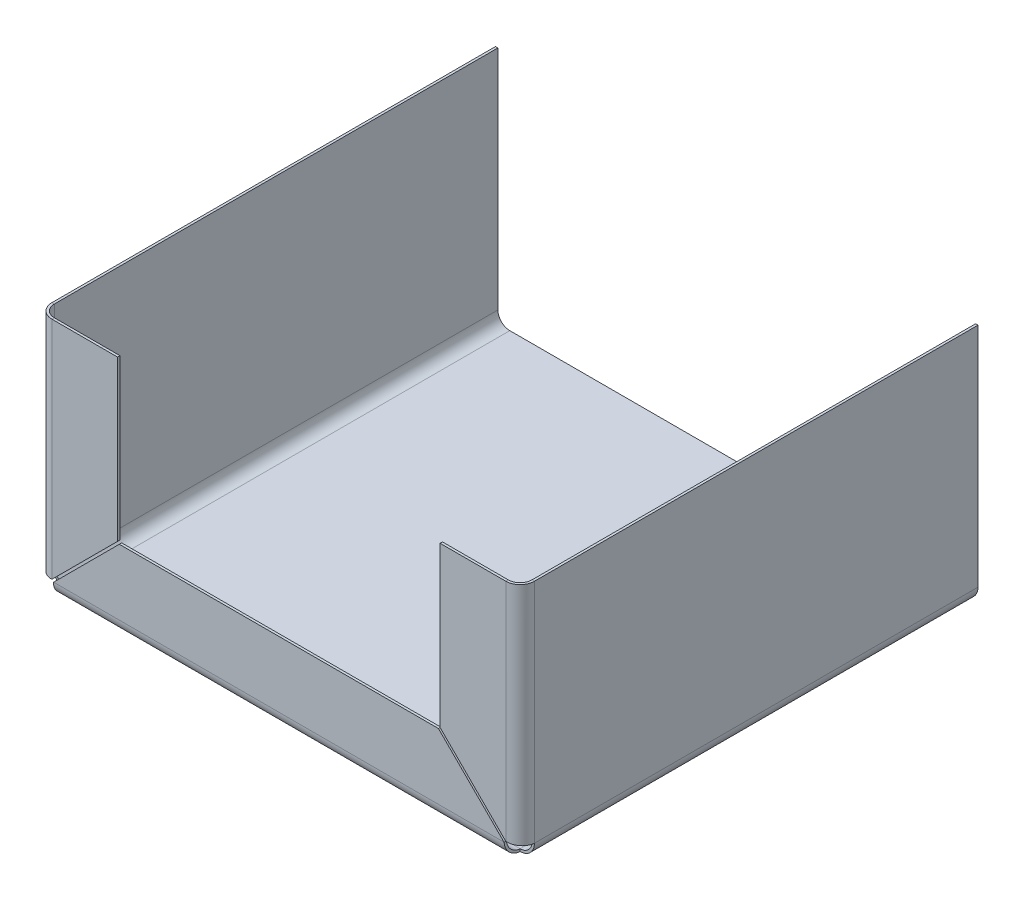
ISO-10303-21;
HEADER;
FILE_DESCRIPTION(('STEP AP214'),'2;1');
FILE_NAME('part.step','',(''),(''),'','','');
FILE_SCHEMA(('AUTOMOTIVE_DESIGN { 1 0 10303 214 1 1 1 1 }'));
ENDSEC;
DATA;
#1=APPLICATION_CONTEXT('core data for automotive mechanical design processes');
#2=APPLICATION_PROTOCOL_DEFINITION('international standard','automotive_design',2000,#1);
#3=PRODUCT_CONTEXT('',#1,'mechanical');
#4=PRODUCT('Part','Part','',(#3));
#5=PRODUCT_RELATED_PRODUCT_CATEGORY('part','',(#4));
#6=PRODUCT_DEFINITION_FORMATION('','',#4);
#7=PRODUCT_DEFINITION_CONTEXT('part definition',#1,'design');
#8=PRODUCT_DEFINITION('design','',#6,#7);
#9=PRODUCT_DEFINITION_SHAPE('','',#8);
#10=(LENGTH_UNIT() NAMED_UNIT(*) SI_UNIT(.MILLI.,.METRE.));
#11=(NAMED_UNIT(*) PLANE_ANGLE_UNIT() SI_UNIT($,.RADIAN.));
#12=(NAMED_UNIT(*) SI_UNIT($,.STERADIAN.) SOLID_ANGLE_UNIT());
#13=UNCERTAINTY_MEASURE_WITH_UNIT(LENGTH_MEASURE(1.E-05),#10,'distance_accuracy_value','');
#14=(GEOMETRIC_REPRESENTATION_CONTEXT(3) GLOBAL_UNCERTAINTY_ASSIGNED_CONTEXT((#13)) GLOBAL_UNIT_ASSIGNED_CONTEXT((#10,
#11,#12)) REPRESENTATION_CONTEXT('',''));
#15=CARTESIAN_POINT('',(0.,0.,0.));
#16=DIRECTION('',(0.,0.,1.));
#17=DIRECTION('',(1.,0.,0.));
#18=AXIS2_PLACEMENT_3D('',#15,#16,#17);
#19=CARTESIAN_POINT('',(51.308,0.,96.868));
#20=DIRECTION('',(-1.,0.,0.));
#21=DIRECTION('',(0.,-1.,0.));
#22=AXIS2_PLACEMENT_3D('',#19,#20,#21);
#23=PLANE('',#22);
#24=DIRECTION('',(0.,1.,0.));
#25=VECTOR('',#24,1.);
#26=CARTESIAN_POINT('',(51.308,50.8,94.328));
#27=LINE('',#26,#25);
#28=CARTESIAN_POINT('',(51.308,50.8,94.328));
#29=VERTEX_POINT('',#28);
#30=CARTESIAN_POINT('',(51.308,2.54,94.328));
#31=VERTEX_POINT('',#30);
#32=EDGE_CURVE('E242',#29,#31,#27,.F.);
#33=ORIENTED_EDGE('',*,*,#32,.T.);
#34=DIRECTION('',(0.,0.,-1.));
#35=VECTOR('',#34,1.);
#36=CARTESIAN_POINT('',(51.308,2.54,96.868));
#37=LINE('',#36,#35);
#38=CARTESIAN_POINT('',(51.308,2.54,0.));
#39=VERTEX_POINT('',#38);
#40=EDGE_CURVE('E588',#31,#39,#37,.T.);
#41=ORIENTED_EDGE('',*,*,#40,.T.);
#42=DIRECTION('',(0.,1.,0.));
#43=VECTOR('',#42,1.);
#44=CARTESIAN_POINT('',(51.308,0.,0.));
#45=LINE('',#44,#43);
#46=CARTESIAN_POINT('',(51.308,50.8,0.));
#47=VERTEX_POINT('',#46);
#48=EDGE_CURVE('E1033',#39,#47,#45,.T.);
#49=ORIENTED_EDGE('',*,*,#48,.T.);
#50=DIRECTION('',(0.,0.,-1.));
#51=VECTOR('',#50,1.);
#52=CARTESIAN_POINT('',(51.308,50.8,96.868));
#53=LINE('',#52,#51);
#54=EDGE_CURVE('E590',#29,#47,#53,.T.);
#55=ORIENTED_EDGE('',*,*,#54,.F.);
#56=EDGE_LOOP('',(#33,#41,#49,#55));
#57=FACE_BOUND('',#56,.T.);
#58=ADVANCED_FACE('F41',(#57),#23,.F.);
#59=CARTESIAN_POINT('',(50.8,50.8,96.868));
#60=DIRECTION('',(0.,1.,0.));
#61=DIRECTION('',(0.,0.,1.));
#62=AXIS2_PLACEMENT_3D('',#59,#60,#61);
#63=PLANE('',#62);
#64=DIRECTION('',(0.,0.,-1.));
#65=VECTOR('',#64,1.);
#66=CARTESIAN_POINT('',(50.8,50.8,96.868));
#67=LINE('',#66,#65);
#68=CARTESIAN_POINT('',(50.8,50.8,94.328));
#69=VERTEX_POINT('',#68);
#70=CARTESIAN_POINT('',(50.8,50.8,0.));
#71=VERTEX_POINT('',#70);
#72=EDGE_CURVE('E1081',#69,#71,#67,.T.);
#73=ORIENTED_EDGE('',*,*,#72,.F.);
#74=DIRECTION('',(1.,0.,0.));
#75=VECTOR('',#74,1.);
#76=CARTESIAN_POINT('',(50.8,50.8,94.328));
#77=LINE('',#76,#75);
#78=EDGE_CURVE('E574',#69,#29,#77,.T.);
#79=ORIENTED_EDGE('',*,*,#78,.T.);
#80=ORIENTED_EDGE('',*,*,#54,.T.);
#81=DIRECTION('',(1.,0.,0.));
#82=VECTOR('',#81,1.);
#83=CARTESIAN_POINT('',(50.8,50.8,0.));
#84=LINE('',#83,#82);
#85=EDGE_CURVE('E1036',#71,#47,#84,.T.);
#86=ORIENTED_EDGE('',*,*,#85,.F.);
#87=EDGE_LOOP('',(#73,#79,#80,#86));
#88=FACE_BOUND('',#87,.T.);
#89=ADVANCED_FACE('F460',(#88),#63,.T.);
#90=CARTESIAN_POINT('',(50.8,0.,96.868));
#91=DIRECTION('',(-1.,0.,0.));
#92=DIRECTION('',(0.,-1.,0.));
#93=AXIS2_PLACEMENT_3D('',#90,#91,#92);
#94=PLANE('',#93);
#95=DIRECTION('',(0.,0.,-1.));
#96=VECTOR('',#95,1.);
#97=CARTESIAN_POINT('',(50.8,2.54,96.868));
#98=LINE('',#97,#96);
#99=CARTESIAN_POINT('',(50.8,2.54,94.328));
#100=VERTEX_POINT('',#99);
#101=CARTESIAN_POINT('',(50.8,2.54,0.));
#102=VERTEX_POINT('',#101);
#103=EDGE_CURVE('E1079',#100,#102,#98,.T.);
#104=ORIENTED_EDGE('',*,*,#103,.F.);
#105=DIRECTION('',(0.,1.,0.));
#106=VECTOR('',#105,1.);
#107=CARTESIAN_POINT('',(50.8,50.8,94.328));
#108=LINE('',#107,#106);
#109=EDGE_CURVE('E56',#69,#100,#108,.F.);
#110=ORIENTED_EDGE('',*,*,#109,.F.);
#111=ORIENTED_EDGE('',*,*,#72,.T.);
#112=DIRECTION('',(0.,1.,0.));
#113=VECTOR('',#112,1.);
#114=CARTESIAN_POINT('',(50.8,0.,0.));
#115=LINE('',#114,#113);
#116=EDGE_CURVE('E1039',#102,#71,#115,.T.);
#117=ORIENTED_EDGE('',*,*,#116,.F.);
#118=EDGE_LOOP('',(#104,#110,#111,#117));
#119=FACE_BOUND('',#118,.T.);
#120=ADVANCED_FACE('F456',(#119),#94,.T.);
#121=CARTESIAN_POINT('',(48.26,2.54,96.868));
#122=DIRECTION('',(0.,0.,-1.));
#123=DIRECTION('',(-1.,0.,0.));
#124=AXIS2_PLACEMENT_3D('',#121,#122,#123);
#125=CYLINDRICAL_SURFACE('',#124,2.54);
#126=DIRECTION('',(0.,0.,-1.));
#127=VECTOR('',#126,1.);
#128=CARTESIAN_POINT('',(48.26,0.,96.868));
#129=LINE('',#128,#127);
#130=CARTESIAN_POINT('',(48.26,0.,94.328));
#131=VERTEX_POINT('',#130);
#132=CARTESIAN_POINT('',(48.26,0.,0.));
#133=VERTEX_POINT('',#132);
#134=EDGE_CURVE('E511',#131,#133,#129,.T.);
#135=ORIENTED_EDGE('',*,*,#134,.F.);
#136=CARTESIAN_POINT('',(48.26,2.54,94.328));
#137=DIRECTION('',(0.,0.,1.));
#138=DIRECTION('',(1.,0.,0.));
#139=AXIS2_PLACEMENT_3D('',#136,#137,#138);
#140=CIRCLE('',#139,2.54);
#141=EDGE_CURVE('E12',#131,#100,#140,.T.);
#142=ORIENTED_EDGE('',*,*,#141,.T.);
#143=ORIENTED_EDGE('',*,*,#103,.T.);
#144=CARTESIAN_POINT('',(48.26,2.54,0.));
#145=DIRECTION('',(0.,0.,-1.));
#146=DIRECTION('',(-1.,0.,0.));
#147=AXIS2_PLACEMENT_3D('',#144,#145,#146);
#148=CIRCLE('',#147,2.54);
#149=EDGE_CURVE('E1042',#133,#102,#148,.F.);
#150=ORIENTED_EDGE('',*,*,#149,.F.);
#151=EDGE_LOOP('',(#135,#142,#143,#150));
#152=FACE_BOUND('',#151,.T.);
#153=ADVANCED_FACE('F453',(#152),#125,.F.);
#154=CARTESIAN_POINT('',(48.26,2.54,94.328));
#155=DIRECTION('',(0.,0.,1.));
#156=DIRECTION('',(1.,0.,0.));
#157=AXIS2_PLACEMENT_3D('',#154,#155,#156);
#158=PLANE('',#157);
#159=DIRECTION('',(1.,0.,0.));
#160=VECTOR('',#159,1.);
#161=CARTESIAN_POINT('',(50.8,2.54,94.328));
#162=LINE('',#161,#160);
#163=EDGE_CURVE('E569',#100,#31,#162,.T.);
#164=ORIENTED_EDGE('',*,*,#163,.F.);
#165=ORIENTED_EDGE('',*,*,#141,.F.);
#166=DIRECTION('',(0.,-1.,0.));
#167=VECTOR('',#166,1.);
#168=CARTESIAN_POINT('',(48.26,0.,94.328));
#169=LINE('',#168,#167);
#170=CARTESIAN_POINT('',(48.26,-0.508,94.328));
#171=VERTEX_POINT('',#170);
#172=EDGE_CURVE('E335',#131,#171,#169,.T.);
#173=ORIENTED_EDGE('',*,*,#172,.T.);
#174=CARTESIAN_POINT('',(48.26,2.54,94.328));
#175=DIRECTION('',(0.,0.,1.));
#176=DIRECTION('',(1.,0.,0.));
#177=AXIS2_PLACEMENT_3D('',#174,#175,#176);
#178=CIRCLE('',#177,3.048);
#179=EDGE_CURVE('E49',#171,#31,#178,.T.);
#180=ORIENTED_EDGE('',*,*,#179,.T.);
#181=EDGE_LOOP('',(#164,#165,#173,#180));
#182=FACE_BOUND('',#181,.T.);
#183=ADVANCED_FACE('F43',(#182),#158,.T.);
#184=CARTESIAN_POINT('',(-50.8,0.,96.868));
#185=DIRECTION('',(0.,1.,0.));
#186=DIRECTION('',(0.,0.,1.));
#187=AXIS2_PLACEMENT_3D('',#184,#185,#186);
#188=PLANE('',#187);
#189=DIRECTION('',(0.,0.,-1.));
#190=VECTOR('',#189,1.);
#191=CARTESIAN_POINT('',(-48.26,0.,96.868));
#192=LINE('',#191,#190);
#193=CARTESIAN_POINT('',(-48.26,0.,94.328));
#194=VERTEX_POINT('',#193);
#195=CARTESIAN_POINT('',(-48.26,0.,0.));
#196=VERTEX_POINT('',#195);
#197=EDGE_CURVE('E498',#194,#196,#192,.T.);
#198=ORIENTED_EDGE('',*,*,#197,.F.);
#199=DIRECTION('',(1.,0.,0.));
#200=VECTOR('',#199,1.);
#201=CARTESIAN_POINT('',(48.26,0.,94.328));
#202=LINE('',#201,#200);
#203=EDGE_CURVE('E506',#131,#194,#202,.F.);
#204=ORIENTED_EDGE('',*,*,#203,.F.);
#205=ORIENTED_EDGE('',*,*,#134,.T.);
#206=DIRECTION('',(1.,0.,0.));
#207=VECTOR('',#206,1.);
#208=CARTESIAN_POINT('',(-50.8,0.,0.));
#209=LINE('',#208,#207);
#210=EDGE_CURVE('E509',#196,#133,#209,.T.);
#211=ORIENTED_EDGE('',*,*,#210,.F.);
#212=EDGE_LOOP('',(#198,#204,#205,#211));
#213=FACE_BOUND('',#212,.T.);
#214=ADVANCED_FACE('F427',(#213),#188,.T.);
#215=CARTESIAN_POINT('',(-50.8,-0.508,96.868));
#216=DIRECTION('',(0.,1.,0.));
#217=DIRECTION('',(0.,0.,1.));
#218=AXIS2_PLACEMENT_3D('',#215,#216,#217);
#219=PLANE('',#218);
#220=DIRECTION('',(1.,0.,0.));
#221=VECTOR('',#220,1.);
#222=CARTESIAN_POINT('',(48.26,-0.508000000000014,94.328));
#223=LINE('',#222,#221);
#224=CARTESIAN_POINT('',(-48.26,-0.508000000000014,94.328));
#225=VERTEX_POINT('',#224);
#226=EDGE_CURVE('E322',#171,#225,#223,.F.);
#227=ORIENTED_EDGE('',*,*,#226,.T.);
#228=DIRECTION('',(0.,0.,-1.));
#229=VECTOR('',#228,1.);
#230=CARTESIAN_POINT('',(-48.26,-0.508,96.868));
#231=LINE('',#230,#229);
#232=CARTESIAN_POINT('',(-48.26,-0.508,0.));
#233=VERTEX_POINT('',#232);
#234=EDGE_CURVE('E1069',#225,#233,#231,.T.);
#235=ORIENTED_EDGE('',*,*,#234,.T.);
#236=DIRECTION('',(1.,0.,0.));
#237=VECTOR('',#236,1.);
#238=CARTESIAN_POINT('',(-50.8,-0.508,0.));
#239=LINE('',#238,#237);
#240=CARTESIAN_POINT('',(48.26,-0.508,0.));
#241=VERTEX_POINT('',#240);
#242=EDGE_CURVE('E1060',#233,#241,#239,.T.);
#243=ORIENTED_EDGE('',*,*,#242,.T.);
#244=DIRECTION('',(0.,0.,-1.));
#245=VECTOR('',#244,1.);
#246=CARTESIAN_POINT('',(48.26,-0.508,96.868));
#247=LINE('',#246,#245);
#248=EDGE_CURVE('E1067',#171,#241,#247,.T.);
#249=ORIENTED_EDGE('',*,*,#248,.F.);
#250=EDGE_LOOP('',(#227,#235,#243,#249));
#251=FACE_BOUND('',#250,.T.);
#252=ADVANCED_FACE('F423',(#251),#219,.F.);
#253=CARTESIAN_POINT('',(-48.26,2.54,96.868));
#254=DIRECTION('',(0.,0.,-1.));
#255=DIRECTION('',(-1.,0.,0.));
#256=AXIS2_PLACEMENT_3D('',#253,#254,#255);
#257=CYLINDRICAL_SURFACE('',#256,2.54);
#258=DIRECTION('',(0.,0.,-1.));
#259=VECTOR('',#258,1.);
#260=CARTESIAN_POINT('',(-50.8,2.54,96.868));
#261=LINE('',#260,#259);
#262=CARTESIAN_POINT('',(-50.8,2.54,94.328));
#263=VERTEX_POINT('',#262);
#264=CARTESIAN_POINT('',(-50.8,2.54,0.));
#265=VERTEX_POINT('',#264);
#266=EDGE_CURVE('E500',#263,#265,#261,.T.);
#267=ORIENTED_EDGE('',*,*,#266,.F.);
#268=CARTESIAN_POINT('',(-48.26,2.54,94.328));
#269=DIRECTION('',(0.,0.,1.));
#270=DIRECTION('',(1.,0.,0.));
#271=AXIS2_PLACEMENT_3D('',#268,#269,#270);
#272=CIRCLE('',#271,2.54);
#273=EDGE_CURVE('E486',#263,#194,#272,.T.);
#274=ORIENTED_EDGE('',*,*,#273,.T.);
#275=ORIENTED_EDGE('',*,*,#197,.T.);
#276=CARTESIAN_POINT('',(-48.26,2.54,0.));
#277=DIRECTION('',(0.,0.,-1.));
#278=DIRECTION('',(-1.,0.,0.));
#279=AXIS2_PLACEMENT_3D('',#276,#277,#278);
#280=CIRCLE('',#279,2.54);
#281=EDGE_CURVE('E1046',#265,#196,#280,.F.);
#282=ORIENTED_EDGE('',*,*,#281,.F.);
#283=EDGE_LOOP('',(#267,#274,#275,#282));
#284=FACE_BOUND('',#283,.T.);
#285=ADVANCED_FACE('F426',(#284),#257,.F.);
#286=CARTESIAN_POINT('',(-48.26,2.54,94.328));
#287=DIRECTION('',(0.,0.,1.));
#288=DIRECTION('',(1.,0.,0.));
#289=AXIS2_PLACEMENT_3D('',#286,#287,#288);
#290=PLANE('',#289);
#291=DIRECTION('',(0.,-1.,0.));
#292=VECTOR('',#291,1.);
#293=CARTESIAN_POINT('',(-48.26,0.,94.328));
#294=LINE('',#293,#292);
#295=EDGE_CURVE('E326',#194,#225,#294,.T.);
#296=ORIENTED_EDGE('',*,*,#295,.F.);
#297=ORIENTED_EDGE('',*,*,#273,.F.);
#298=DIRECTION('',(-1.,0.,0.));
#299=VECTOR('',#298,1.);
#300=CARTESIAN_POINT('',(-50.8,2.54,94.328));
#301=LINE('',#300,#299);
#302=CARTESIAN_POINT('',(-51.308,2.54,94.328));
#303=VERTEX_POINT('',#302);
#304=EDGE_CURVE('E372',#263,#303,#301,.T.);
#305=ORIENTED_EDGE('',*,*,#304,.T.);
#306=CARTESIAN_POINT('',(-48.26,2.54,94.328));
#307=DIRECTION('',(0.,0.,1.));
#308=DIRECTION('',(1.,0.,0.));
#309=AXIS2_PLACEMENT_3D('',#306,#307,#308);
#310=CIRCLE('',#309,3.048);
#311=EDGE_CURVE('E489',#303,#225,#310,.T.);
#312=ORIENTED_EDGE('',*,*,#311,.T.);
#313=EDGE_LOOP('',(#296,#297,#305,#312));
#314=FACE_BOUND('',#313,.T.);
#315=ADVANCED_FACE('F445',(#314),#290,.T.);
#316=CARTESIAN_POINT('',(-50.8,50.8,96.868));
#317=DIRECTION('',(1.,0.,0.));
#318=DIRECTION('',(0.,1.,0.));
#319=AXIS2_PLACEMENT_3D('',#316,#317,#318);
#320=PLANE('',#319);
#321=DIRECTION('',(0.,0.,-1.));
#322=VECTOR('',#321,1.);
#323=CARTESIAN_POINT('',(-50.8,50.8,96.868));
#324=LINE('',#323,#322);
#325=CARTESIAN_POINT('',(-50.8,50.8,94.328));
#326=VERTEX_POINT('',#325);
#327=CARTESIAN_POINT('',(-50.8,50.8,0.));
#328=VERTEX_POINT('',#327);
#329=EDGE_CURVE('E1075',#326,#328,#324,.T.);
#330=ORIENTED_EDGE('',*,*,#329,.F.);
#331=DIRECTION('',(0.,-1.,0.));
#332=VECTOR('',#331,1.);
#333=CARTESIAN_POINT('',(-50.8,2.54,94.328));
#334=LINE('',#333,#332);
#335=EDGE_CURVE('E378',#263,#326,#334,.F.);
#336=ORIENTED_EDGE('',*,*,#335,.F.);
#337=ORIENTED_EDGE('',*,*,#266,.T.);
#338=DIRECTION('',(0.,-1.,0.));
#339=VECTOR('',#338,1.);
#340=CARTESIAN_POINT('',(-50.8,50.8,0.));
#341=LINE('',#340,#339);
#342=EDGE_CURVE('E1048',#328,#265,#341,.T.);
#343=ORIENTED_EDGE('',*,*,#342,.F.);
#344=EDGE_LOOP('',(#330,#336,#337,#343));
#345=FACE_BOUND('',#344,.T.);
#346=ADVANCED_FACE('F437',(#345),#320,.T.);
#347=CARTESIAN_POINT('',(-51.308,50.8,96.868));
#348=DIRECTION('',(1.,0.,0.));
#349=DIRECTION('',(0.,1.,0.));
#350=AXIS2_PLACEMENT_3D('',#347,#348,#349);
#351=PLANE('',#350);
#352=DIRECTION('',(0.,-1.,0.));
#353=VECTOR('',#352,1.);
#354=CARTESIAN_POINT('',(-51.308,2.54,94.328));
#355=LINE('',#354,#353);
#356=CARTESIAN_POINT('',(-51.308,50.8,94.328));
#357=VERTEX_POINT('',#356);
#358=EDGE_CURVE('E373',#303,#357,#355,.F.);
#359=ORIENTED_EDGE('',*,*,#358,.T.);
#360=DIRECTION('',(0.,0.,-1.));
#361=VECTOR('',#360,1.);
#362=CARTESIAN_POINT('',(-51.308,50.8,96.868));
#363=LINE('',#362,#361);
#364=CARTESIAN_POINT('',(-51.308,50.8,0.));
#365=VERTEX_POINT('',#364);
#366=EDGE_CURVE('E1073',#357,#365,#363,.T.);
#367=ORIENTED_EDGE('',*,*,#366,.T.);
#368=DIRECTION('',(0.,-1.,0.));
#369=VECTOR('',#368,1.);
#370=CARTESIAN_POINT('',(-51.308,50.8,0.));
#371=LINE('',#370,#369);
#372=CARTESIAN_POINT('',(-51.308,2.54,0.));
#373=VERTEX_POINT('',#372);
#374=EDGE_CURVE('E1054',#365,#373,#371,.T.);
#375=ORIENTED_EDGE('',*,*,#374,.T.);
#376=DIRECTION('',(0.,0.,-1.));
#377=VECTOR('',#376,1.);
#378=CARTESIAN_POINT('',(-51.308,2.54,96.868));
#379=LINE('',#378,#377);
#380=EDGE_CURVE('E1071',#303,#373,#379,.T.);
#381=ORIENTED_EDGE('',*,*,#380,.F.);
#382=EDGE_LOOP('',(#359,#367,#375,#381));
#383=FACE_BOUND('',#382,.T.);
#384=ADVANCED_FACE('F433',(#383),#351,.F.);
#385=CARTESIAN_POINT('',(-50.8,2.54,0.));
#386=DIRECTION('',(0.,0.,-1.));
#387=DIRECTION('',(-1.,0.,0.));
#388=AXIS2_PLACEMENT_3D('',#385,#386,#387);
#389=PLANE('',#388);
#390=DIRECTION('',(-1.,0.,0.));
#391=VECTOR('',#390,1.);
#392=CARTESIAN_POINT('',(-50.8,2.54,0.));
#393=LINE('',#392,#391);
#394=EDGE_CURVE('E1092',#265,#373,#393,.T.);
#395=ORIENTED_EDGE('',*,*,#394,.F.);
#396=ORIENTED_EDGE('',*,*,#281,.T.);
#397=DIRECTION('',(0.,1.,0.));
#398=VECTOR('',#397,1.);
#399=CARTESIAN_POINT('',(-48.26,-0.508,0.));
#400=LINE('',#399,#398);
#401=EDGE_CURVE('E1090',#233,#196,#400,.T.);
#402=ORIENTED_EDGE('',*,*,#401,.F.);
#403=CARTESIAN_POINT('',(-48.26,2.54,0.));
#404=DIRECTION('',(0.,0.,1.));
#405=DIRECTION('',(1.,0.,0.));
#406=AXIS2_PLACEMENT_3D('',#403,#404,#405);
#407=CIRCLE('',#406,3.048);
#408=EDGE_CURVE('E1057',#373,#233,#407,.T.);
#409=ORIENTED_EDGE('',*,*,#408,.F.);
#410=EDGE_LOOP('',(#395,#396,#402,#409));
#411=FACE_BOUND('',#410,.T.);
#412=ADVANCED_FACE('F436',(#411),#389,.T.);
#413=CARTESIAN_POINT('',(-48.26,-0.508,0.));
#414=DIRECTION('',(0.,0.,-1.));
#415=DIRECTION('',(-1.,0.,0.));
#416=AXIS2_PLACEMENT_3D('',#413,#414,#415);
#417=PLANE('',#416);
#418=ORIENTED_EDGE('',*,*,#342,.T.);
#419=ORIENTED_EDGE('',*,*,#394,.T.);
#420=ORIENTED_EDGE('',*,*,#374,.F.);
#421=DIRECTION('',(1.,0.,0.));
#422=VECTOR('',#421,1.);
#423=CARTESIAN_POINT('',(-51.308,50.8,0.));
#424=LINE('',#423,#422);
#425=EDGE_CURVE('E1051',#365,#328,#424,.T.);
#426=ORIENTED_EDGE('',*,*,#425,.T.);
#427=EDGE_LOOP('',(#418,#419,#420,#426));
#428=FACE_BOUND('',#427,.T.);
#429=ADVANCED_FACE('F473',(#428),#417,.T.);
#430=CARTESIAN_POINT('',(48.26,0.,0.));
#431=DIRECTION('',(0.,0.,-1.));
#432=DIRECTION('',(-1.,0.,0.));
#433=AXIS2_PLACEMENT_3D('',#430,#431,#432);
#434=PLANE('',#433);
#435=DIRECTION('',(0.,-1.,0.));
#436=VECTOR('',#435,1.);
#437=CARTESIAN_POINT('',(48.26,0.,0.));
#438=LINE('',#437,#436);
#439=EDGE_CURVE('E1087',#133,#241,#438,.T.);
#440=ORIENTED_EDGE('',*,*,#439,.F.);
#441=ORIENTED_EDGE('',*,*,#149,.T.);
#442=DIRECTION('',(-1.,0.,0.));
#443=VECTOR('',#442,1.);
#444=CARTESIAN_POINT('',(51.308,2.54,0.));
#445=LINE('',#444,#443);
#446=EDGE_CURVE('E1084',#39,#102,#445,.T.);
#447=ORIENTED_EDGE('',*,*,#446,.F.);
#448=CARTESIAN_POINT('',(48.26,2.54,0.));
#449=DIRECTION('',(0.,0.,1.));
#450=DIRECTION('',(1.,0.,0.));
#451=AXIS2_PLACEMENT_3D('',#448,#449,#450);
#452=CIRCLE('',#451,3.048);
#453=EDGE_CURVE('E1063',#241,#39,#452,.T.);
#454=ORIENTED_EDGE('',*,*,#453,.F.);
#455=EDGE_LOOP('',(#440,#441,#447,#454));
#456=FACE_BOUND('',#455,.T.);
#457=ADVANCED_FACE('F469',(#456),#434,.T.);
#458=CARTESIAN_POINT('',(51.308,2.54,0.));
#459=DIRECTION('',(0.,0.,-1.));
#460=DIRECTION('',(-1.,0.,0.));
#461=AXIS2_PLACEMENT_3D('',#458,#459,#460);
#462=PLANE('',#461);
#463=ORIENTED_EDGE('',*,*,#210,.T.);
#464=ORIENTED_EDGE('',*,*,#439,.T.);
#465=ORIENTED_EDGE('',*,*,#242,.F.);
#466=ORIENTED_EDGE('',*,*,#401,.T.);
#467=EDGE_LOOP('',(#463,#464,#465,#466));
#468=FACE_BOUND('',#467,.T.);
#469=ADVANCED_FACE('F441',(#468),#462,.T.);
#470=CARTESIAN_POINT('',(-51.308,50.8,96.868));
#471=DIRECTION('',(0.,1.,0.));
#472=DIRECTION('',(0.,0.,1.));
#473=AXIS2_PLACEMENT_3D('',#470,#471,#472);
#474=PLANE('',#473);
#475=DIRECTION('',(-1.,0.,0.));
#476=VECTOR('',#475,1.);
#477=CARTESIAN_POINT('',(-50.8,50.8,94.328));
#478=LINE('',#477,#476);
#479=EDGE_CURVE('E1031',#326,#357,#478,.T.);
#480=ORIENTED_EDGE('',*,*,#479,.F.);
#481=ORIENTED_EDGE('',*,*,#329,.T.);
#482=ORIENTED_EDGE('',*,*,#425,.F.);
#483=ORIENTED_EDGE('',*,*,#366,.F.);
#484=EDGE_LOOP('',(#480,#481,#482,#483));
#485=FACE_BOUND('',#484,.T.);
#486=ADVANCED_FACE('F431',(#485),#474,.T.);
#487=CARTESIAN_POINT('',(-48.26,2.54,96.868));
#488=DIRECTION('',(0.,0.,-1.));
#489=DIRECTION('',(-1.,0.,0.));
#490=AXIS2_PLACEMENT_3D('',#487,#488,#489);
#491=CYLINDRICAL_SURFACE('',#490,3.048);
#492=ORIENTED_EDGE('',*,*,#311,.F.);
#493=ORIENTED_EDGE('',*,*,#380,.T.);
#494=ORIENTED_EDGE('',*,*,#408,.T.);
#495=ORIENTED_EDGE('',*,*,#234,.F.);
#496=EDGE_LOOP('',(#492,#493,#494,#495));
#497=FACE_BOUND('',#496,.T.);
#498=ADVANCED_FACE('F422',(#497),#491,.T.);
#499=CARTESIAN_POINT('',(48.26,2.54,96.868));
#500=DIRECTION('',(0.,0.,-1.));
#501=DIRECTION('',(-1.,0.,0.));
#502=AXIS2_PLACEMENT_3D('',#499,#500,#501);
#503=CYLINDRICAL_SURFACE('',#502,3.048);
#504=ORIENTED_EDGE('',*,*,#179,.F.);
#505=ORIENTED_EDGE('',*,*,#248,.T.);
#506=ORIENTED_EDGE('',*,*,#453,.T.);
#507=ORIENTED_EDGE('',*,*,#40,.F.);
#508=EDGE_LOOP('',(#504,#505,#506,#507));
#509=FACE_BOUND('',#508,.T.);
#510=ADVANCED_FACE('F418',(#509),#503,.T.);
#511=CARTESIAN_POINT('',(48.26,2.54,0.));
#512=DIRECTION('',(0.,0.,-1.));
#513=DIRECTION('',(-1.,0.,0.));
#514=AXIS2_PLACEMENT_3D('',#511,#512,#513);
#515=PLANE('',#514);
#516=ORIENTED_EDGE('',*,*,#48,.F.);
#517=ORIENTED_EDGE('',*,*,#446,.T.);
#518=ORIENTED_EDGE('',*,*,#116,.T.);
#519=ORIENTED_EDGE('',*,*,#85,.T.);
#520=EDGE_LOOP('',(#516,#517,#518,#519));
#521=FACE_BOUND('',#520,.T.);
#522=ADVANCED_FACE('F404',(#521),#515,.T.);
#523=CARTESIAN_POINT('',(-48.26,50.8,94.328));
#524=DIRECTION('',(0.,1.,0.));
#525=DIRECTION('',(0.,0.,1.));
#526=AXIS2_PLACEMENT_3D('',#523,#524,#525);
#527=PLANE('',#526);
#528=DIRECTION('',(0.,0.,1.));
#529=VECTOR('',#528,1.);
#530=CARTESIAN_POINT('',(-48.26,50.8,96.868));
#531=LINE('',#530,#529);
#532=CARTESIAN_POINT('',(-48.26,50.8,96.868));
#533=VERTEX_POINT('',#532);
#534=CARTESIAN_POINT('',(-48.26,50.8,97.376));
#535=VERTEX_POINT('',#534);
#536=EDGE_CURVE('E345',#533,#535,#531,.T.);
#537=ORIENTED_EDGE('',*,*,#536,.F.);
#538=CARTESIAN_POINT('',(-48.26,50.8,94.328));
#539=DIRECTION('',(0.,-1.,0.));
#540=DIRECTION('',(0.,0.,-1.));
#541=AXIS2_PLACEMENT_3D('',#538,#539,#540);
#542=CIRCLE('',#541,2.54000000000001);
#543=EDGE_CURVE('E374',#326,#533,#542,.F.);
#544=ORIENTED_EDGE('',*,*,#543,.F.);
#545=ORIENTED_EDGE('',*,*,#479,.T.);
#546=CARTESIAN_POINT('',(-48.26,50.8,94.328));
#547=DIRECTION('',(0.,-1.,0.));
#548=DIRECTION('',(0.,0.,-1.));
#549=AXIS2_PLACEMENT_3D('',#546,#547,#548);
#550=CIRCLE('',#549,3.04800000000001);
#551=EDGE_CURVE('E369',#357,#535,#550,.F.);
#552=ORIENTED_EDGE('',*,*,#551,.T.);
#553=EDGE_LOOP('',(#537,#544,#545,#552));
#554=FACE_BOUND('',#553,.T.);
#555=ADVANCED_FACE('F401',(#554),#527,.T.);
#556=CARTESIAN_POINT('',(-48.26,2.8992102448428,97.38108));
#557=CARTESIAN_POINT('',(-48.6597188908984,2.86927069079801,97.38108));
#558=CARTESIAN_POINT('',(-49.0591372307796,2.83934187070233,97.3016164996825));
#559=CARTESIAN_POINT('',(-49.7975890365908,2.77947349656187,96.9957397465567));
#560=CARTESIAN_POINT('',(-50.136260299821,2.74953930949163,96.7694468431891));
#561=CARTESIAN_POINT('',(-50.7014468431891,2.68967093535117,96.2042602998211));
#562=CARTESIAN_POINT('',(-50.9277397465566,2.65973674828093,95.8655890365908));
#563=CARTESIAN_POINT('',(-51.2336164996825,2.59986837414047,95.1271372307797));
#564=CARTESIAN_POINT('',(-51.31308,2.56993955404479,94.7277188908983));
#565=CARTESIAN_POINT('',(-51.31308,2.54,94.328));
#566=CARTESIAN_POINT('',(-48.26,2.8992102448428,97.376));
#567=CARTESIAN_POINT('',(-48.6590537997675,2.86927069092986,97.376));
#568=CARTESIAN_POINT('',(-49.0578075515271,2.83934187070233,97.2966687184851));
#569=CARTESIAN_POINT('',(-49.7950306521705,2.77947349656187,96.9913009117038));
#570=CARTESIAN_POINT('',(-50.1331384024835,2.74953930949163,96.7653845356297));
#571=CARTESIAN_POINT('',(-50.6973845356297,2.68967093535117,96.2011384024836));
#572=CARTESIAN_POINT('',(-50.9233009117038,2.65973674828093,95.8630306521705));
#573=CARTESIAN_POINT('',(-51.228668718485,2.59986837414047,95.1258075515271));
#574=CARTESIAN_POINT('',(-51.308,2.56993955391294,94.7270537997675));
#575=CARTESIAN_POINT('',(-51.308,2.54,94.328));
#576=CARTESIAN_POINT('',(-48.26,2.8992102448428,96.868));
#577=CARTESIAN_POINT('',(-48.5925446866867,2.86927070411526,96.868));
#578=CARTESIAN_POINT('',(-48.9248396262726,2.83934187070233,96.8018905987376));
#579=CARTESIAN_POINT('',(-49.5391922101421,2.77947349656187,96.5474174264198));
#580=CARTESIAN_POINT('',(-49.8209486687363,2.74953930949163,96.3591537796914));
#581=CARTESIAN_POINT('',(-50.2911537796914,2.68967093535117,95.8889486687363));
#582=CARTESIAN_POINT('',(-50.4794174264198,2.65973674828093,95.6071922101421));
#583=CARTESIAN_POINT('',(-50.7338905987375,2.59986837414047,94.9928396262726));
#584=CARTESIAN_POINT('',(-50.8,2.56993954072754,94.6605446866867));
#585=CARTESIAN_POINT('',(-50.8,2.54,94.328));
#586=CARTESIAN_POINT('',(-48.26,2.8992102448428,96.8628692));
#587=CARTESIAN_POINT('',(-48.5918729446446,2.86927070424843,96.8628692));
#588=CARTESIAN_POINT('',(-48.9234966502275,2.83934187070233,96.7968933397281));
#589=CARTESIAN_POINT('',(-49.5366082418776,2.77947349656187,96.5429342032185));
#590=CARTESIAN_POINT('',(-49.8177955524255,2.74953930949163,96.3550508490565));
#591=CARTESIAN_POINT('',(-50.2870508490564,2.68967093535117,95.8857955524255));
#592=CARTESIAN_POINT('',(-50.4749342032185,2.65973674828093,95.6046082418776));
#593=CARTESIAN_POINT('',(-50.7288933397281,2.59986837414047,94.9914966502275));
#594=CARTESIAN_POINT('',(-50.7948692,2.56993954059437,94.6598729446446));
#595=CARTESIAN_POINT('',(-50.7948692,2.54,94.328));
#596=B_SPLINE_SURFACE_WITH_KNOTS('',1,3,((#556,#557,#558,#559,#560,#561,#562,#563,#564,#565),
(#566,#567,#568,#569,#570,#571,#572,#573,#574,#575),(#576,#577,#578,#579,#580,#581,#582,#583,
#584,#585),(#586,#587,#588,#589,#590,#591,#592,#593,#594,#595)),.UNSPECIFIED.,.F.,.F.,.F.,(2,1,
1,2),(4,2,2,2,4),(-0.01,0.,1.,1.0101),(0.,0.25,0.5,0.75,1.),.UNSPECIFIED.);
#597=CARTESIAN_POINT('',(-48.26,2.8992102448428,96.868));
#598=CARTESIAN_POINT('',(-48.3015606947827,2.89546847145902,96.8680008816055));
#599=CARTESIAN_POINT('',(-48.3431213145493,2.89172669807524,96.8669799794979));
#600=CARTESIAN_POINT('',(-48.426142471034,2.88424315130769,96.8629009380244));
#601=CARTESIAN_POINT('',(-48.4676030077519,2.88050137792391,96.8598427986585));
#602=CARTESIAN_POINT('',(-48.5503240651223,2.87301783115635,96.8516956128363));
#603=CARTESIAN_POINT('',(-48.5915845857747,2.86927605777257,96.84660656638));
#604=CARTESIAN_POINT('',(-48.6738062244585,2.86179251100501,96.8344101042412));
#605=CARTESIAN_POINT('',(-48.7147673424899,2.85805073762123,96.8273026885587));
#606=CARTESIAN_POINT('',(-48.7962914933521,2.85056719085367,96.8110865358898));
#607=CARTESIAN_POINT('',(-48.836854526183,2.84682541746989,96.8019777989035));
#608=CARTESIAN_POINT('',(-48.9174847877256,2.83934187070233,96.7817809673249));
#609=CARTESIAN_POINT('',(-48.9575520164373,2.83560009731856,96.7706928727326));
#610=CARTESIAN_POINT('',(-49.0370941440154,2.828116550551,96.746564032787));
#611=CARTESIAN_POINT('',(-49.0765690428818,2.82437477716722,96.7335232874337));
#612=CARTESIAN_POINT('',(-49.1548314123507,2.81689123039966,96.7055205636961));
#613=CARTESIAN_POINT('',(-49.1936188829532,2.81314945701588,96.690558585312));
#614=CARTESIAN_POINT('',(-49.2704129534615,2.80566591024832,96.6587494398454));
#615=CARTESIAN_POINT('',(-49.3084195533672,2.80192413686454,96.6419022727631));
#616=CARTESIAN_POINT('',(-49.3835603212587,2.79444059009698,96.6063633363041));
#617=CARTESIAN_POINT('',(-49.4206944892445,2.79069881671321,96.5876715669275));
#618=CARTESIAN_POINT('',(-49.4940009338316,2.78321526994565,96.5484884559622));
#619=CARTESIAN_POINT('',(-49.5301732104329,2.77947349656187,96.5279971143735));
#620=CARTESIAN_POINT('',(-49.6014687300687,2.77198994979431,96.485264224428));
#621=CARTESIAN_POINT('',(-49.6365919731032,2.76824817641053,96.4630226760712));
#622=CARTESIAN_POINT('',(-49.7057048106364,2.76076462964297,96.4168429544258));
#623=CARTESIAN_POINT('',(-49.7396944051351,2.75702285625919,96.3929047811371));
#624=CARTESIAN_POINT('',(-49.8064580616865,2.74953930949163,96.3433894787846));
#625=CARTESIAN_POINT('',(-49.8392321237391,2.74579753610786,96.3178123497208));
#626=CARTESIAN_POINT('',(-49.9034857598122,2.7383139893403,96.265080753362));
#627=CARTESIAN_POINT('',(-49.9349653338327,2.73457221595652,96.2379262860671));
#628=CARTESIAN_POINT('',(-49.9965541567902,2.72708866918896,96.1821054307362));
#629=CARTESIAN_POINT('',(-50.0266634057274,2.72334689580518,96.1534390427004));
#630=CARTESIAN_POINT('',(-50.0854390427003,2.71586334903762,96.0946634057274));
#631=CARTESIAN_POINT('',(-50.1141054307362,2.71212157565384,96.0645541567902));
#632=CARTESIAN_POINT('',(-50.169926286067,2.70463802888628,96.0029653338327));
#633=CARTESIAN_POINT('',(-50.197080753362,2.70089625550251,95.9714857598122));
#634=CARTESIAN_POINT('',(-50.2498123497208,2.69341270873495,95.9072321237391));
#635=CARTESIAN_POINT('',(-50.2753894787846,2.68967093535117,95.8744580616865));
#636=CARTESIAN_POINT('',(-50.3249047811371,2.68218738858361,95.8076944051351));
#637=CARTESIAN_POINT('',(-50.3488429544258,2.67844561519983,95.7737048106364));
#638=CARTESIAN_POINT('',(-50.3950226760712,2.67096206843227,95.7045919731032));
#639=CARTESIAN_POINT('',(-50.417264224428,2.66722029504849,95.6694687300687));
#640=CARTESIAN_POINT('',(-50.4599971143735,2.65973674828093,95.5981732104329));
#641=CARTESIAN_POINT('',(-50.4804884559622,2.65599497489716,95.5620009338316));
#642=CARTESIAN_POINT('',(-50.5196715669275,2.6485114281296,95.4886944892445));
#643=CARTESIAN_POINT('',(-50.5383633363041,2.64476965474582,95.4515603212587));
#644=CARTESIAN_POINT('',(-50.573902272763,2.63728610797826,95.3764195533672));
#645=CARTESIAN_POINT('',(-50.5907494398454,2.63354433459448,95.3384129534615));
#646=CARTESIAN_POINT('',(-50.622558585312,2.62606078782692,95.2616188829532));
#647=CARTESIAN_POINT('',(-50.6375205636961,2.62231901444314,95.2228314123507));
#648=CARTESIAN_POINT('',(-50.6655232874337,2.61483546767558,95.1445690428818));
#649=CARTESIAN_POINT('',(-50.678564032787,2.61109369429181,95.1050941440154));
#650=CARTESIAN_POINT('',(-50.7026928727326,2.60361014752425,95.0255520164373));
#651=CARTESIAN_POINT('',(-50.7137809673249,2.59986837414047,94.9854847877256));
#652=CARTESIAN_POINT('',(-50.7339777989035,2.59238482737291,94.904854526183));
#653=CARTESIAN_POINT('',(-50.7430865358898,2.58864305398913,94.8642914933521));
#654=CARTESIAN_POINT('',(-50.7593026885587,2.58115950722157,94.7827673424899));
#655=CARTESIAN_POINT('',(-50.7664101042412,2.57741773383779,94.7418062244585));
#656=CARTESIAN_POINT('',(-50.77860656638,2.56993418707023,94.6595845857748));
#657=CARTESIAN_POINT('',(-50.7836956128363,2.56619241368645,94.6183240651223));
#658=CARTESIAN_POINT('',(-50.7918427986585,2.5587088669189,94.5356030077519));
#659=CARTESIAN_POINT('',(-50.7949009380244,2.55496709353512,94.494142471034));
#660=CARTESIAN_POINT('',(-50.7989799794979,2.54748354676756,94.4111213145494));
#661=CARTESIAN_POINT('',(-50.8000008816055,2.54374177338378,94.3695606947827));
#662=CARTESIAN_POINT('',(-50.8,2.54,94.328));
#663=B_SPLINE_CURVE_WITH_KNOTS('',3,(#597,#598,#599,#600,#601,#602,#603,#604,#605,#606,#607,
#608,#609,#610,#611,#612,#613,#614,#615,#616,#617,#618,#619,#620,#621,#622,#623,#624,#625,#626,
#627,#628,#629,#630,#631,#632,#633,#634,#635,#636,#637,#638,#639,#640,#641,#642,#643,#644,#645,
#646,#647,#648,#649,#650,#651,#652,#653,#654,#655,#656,#657,#658,#659,#660,#661,#662),
.UNSPECIFIED.,.F.,.F.,(4,2,2,2,2,2,2,2,2,2,2,2,2,2,2,2,2,2,2,2,2,2,2,2,2,2,2,2,2,2,2,2,4),(0.,
0.125173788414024,0.250347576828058,0.375521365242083,0.500695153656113,0.625868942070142,
0.751042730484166,0.876216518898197,1.00139030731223,1.12656409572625,1.25173788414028,
1.37691167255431,1.50208546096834,1.62725924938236,1.75243303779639,1.87760682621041,
2.00278061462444,2.12795440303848,2.25312819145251,2.37830197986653,2.50347576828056,
2.62864955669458,2.75382334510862,2.87899713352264,3.00417092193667,3.12934471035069,
3.25451849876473,3.37969228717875,3.50486607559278,3.6300398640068,3.75521365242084,
3.88038744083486,4.00556122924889),.UNSPECIFIED.);
#664=CARTESIAN_POINT('',(-48.26,2.8992102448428,96.868));
#665=VERTEX_POINT('',#664);
#666=EDGE_CURVE('E368',#665,#263,#663,.T.);
#667=DIRECTION('',(0.,0.,-1.));
#668=VECTOR('',#667,1.);
#669=CARTESIAN_POINT('',(-48.26,2.8992102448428,96.868));
#670=LINE('',#669,#668);
#671=CARTESIAN_POINT('',(-48.26,2.8992102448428,97.376));
#672=VERTEX_POINT('',#671);
#673=EDGE_CURVE('E365',#672,#665,#670,.T.);
#674=CARTESIAN_POINT('',(-48.26,2.8992102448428,97.376));
#675=CARTESIAN_POINT('',(-48.3098728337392,2.89546847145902,97.3760010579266));
#676=CARTESIAN_POINT('',(-48.3597455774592,2.89172669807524,97.3747759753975));
#677=CARTESIAN_POINT('',(-48.4593709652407,2.88424315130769,97.3698811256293));
#678=CARTESIAN_POINT('',(-48.5091236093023,2.88050137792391,97.3662113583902));
#679=CARTESIAN_POINT('',(-48.6083888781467,2.87301783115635,97.3564347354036));
#680=CARTESIAN_POINT('',(-48.6579015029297,2.86927605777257,97.350327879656));
#681=CARTESIAN_POINT('',(-48.7565674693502,2.86179251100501,97.3356921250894));
#682=CARTESIAN_POINT('',(-48.8057208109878,2.85805073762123,97.3271632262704));
#683=CARTESIAN_POINT('',(-48.9035497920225,2.85056719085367,97.3077038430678));
#684=CARTESIAN_POINT('',(-48.9522254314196,2.84682541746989,97.2967733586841));
#685=CARTESIAN_POINT('',(-49.0489817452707,2.83934187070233,97.2725371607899));
#686=CARTESIAN_POINT('',(-49.0970624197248,2.83560009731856,97.2592314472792));
#687=CARTESIAN_POINT('',(-49.1925129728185,2.828116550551,97.2302768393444));
#688=CARTESIAN_POINT('',(-49.2398828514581,2.82437477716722,97.2146279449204));
#689=CARTESIAN_POINT('',(-49.3337976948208,2.81689123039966,97.1810246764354));
#690=CARTESIAN_POINT('',(-49.3803426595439,2.81314945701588,97.1630703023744));
#691=CARTESIAN_POINT('',(-49.4724955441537,2.80566591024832,97.1248993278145));
#692=CARTESIAN_POINT('',(-49.5181034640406,2.80192413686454,97.1046827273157));
#693=CARTESIAN_POINT('',(-49.6082723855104,2.79444059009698,97.0620360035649));
#694=CARTESIAN_POINT('',(-49.6528333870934,2.79069881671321,97.039605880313));
#695=CARTESIAN_POINT('',(-49.7408011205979,2.78321526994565,96.9925861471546));
#696=CARTESIAN_POINT('',(-49.7842078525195,2.77947349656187,96.9679965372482));
#697=CARTESIAN_POINT('',(-49.8697624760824,2.77198994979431,96.9167170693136));
#698=CARTESIAN_POINT('',(-49.9119103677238,2.76824817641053,96.8900272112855));
#699=CARTESIAN_POINT('',(-49.9948457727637,2.76076462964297,96.8346115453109));
#700=CARTESIAN_POINT('',(-50.0356332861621,2.75702285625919,96.8058857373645));
#701=CARTESIAN_POINT('',(-50.1157496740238,2.74953930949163,96.7464673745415));
#702=CARTESIAN_POINT('',(-50.1550785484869,2.74579753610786,96.7157748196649));
#703=CARTESIAN_POINT('',(-50.2321829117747,2.7383139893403,96.6524969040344));
#704=CARTESIAN_POINT('',(-50.2699584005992,2.73457221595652,96.6199115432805));
#705=CARTESIAN_POINT('',(-50.3438649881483,2.72708866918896,96.5529265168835));
#706=CARTESIAN_POINT('',(-50.3799960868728,2.72334689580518,96.5185268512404));
#707=CARTESIAN_POINT('',(-50.4505268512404,2.71586334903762,96.4479960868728));
#708=CARTESIAN_POINT('',(-50.4849265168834,2.71212157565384,96.4118649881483));
#709=CARTESIAN_POINT('',(-50.5519115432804,2.70463802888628,96.3379584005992));
#710=CARTESIAN_POINT('',(-50.5844969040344,2.70089625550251,96.3001829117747));
#711=CARTESIAN_POINT('',(-50.6477748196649,2.69341270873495,96.223078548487));
#712=CARTESIAN_POINT('',(-50.6784673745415,2.68967093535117,96.1837496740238));
#713=CARTESIAN_POINT('',(-50.7378857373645,2.68218738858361,96.1036332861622));
#714=CARTESIAN_POINT('',(-50.7666115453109,2.67844561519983,96.0628457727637));
#715=CARTESIAN_POINT('',(-50.8220272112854,2.67096206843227,95.9799103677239));
#716=CARTESIAN_POINT('',(-50.8487170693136,2.66722029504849,95.9377624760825));
#717=CARTESIAN_POINT('',(-50.8999965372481,2.65973674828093,95.8522078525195));
#718=CARTESIAN_POINT('',(-50.9245861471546,2.65599497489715,95.8088011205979));
#719=CARTESIAN_POINT('',(-50.971605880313,2.6485114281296,95.7208333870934));
#720=CARTESIAN_POINT('',(-50.9940360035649,2.64476965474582,95.6762723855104));
#721=CARTESIAN_POINT('',(-51.0366827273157,2.63728610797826,95.5861034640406));
#722=CARTESIAN_POINT('',(-51.0568993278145,2.63354433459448,95.5404955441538));
#723=CARTESIAN_POINT('',(-51.0950703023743,2.62606078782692,95.4483426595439));
#724=CARTESIAN_POINT('',(-51.1130246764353,2.62231901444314,95.4017976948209));
#725=CARTESIAN_POINT('',(-51.1466279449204,2.61483546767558,95.3078828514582));
#726=CARTESIAN_POINT('',(-51.1622768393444,2.61109369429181,95.2605129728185));
#727=CARTESIAN_POINT('',(-51.1912314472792,2.60361014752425,95.1650624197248));
#728=CARTESIAN_POINT('',(-51.2045371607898,2.59986837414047,95.1169817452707));
#729=CARTESIAN_POINT('',(-51.2287733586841,2.59238482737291,95.0202254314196));
#730=CARTESIAN_POINT('',(-51.2397038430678,2.58864305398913,94.9715497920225));
#731=CARTESIAN_POINT('',(-51.2591632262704,2.58115950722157,94.8737208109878));
#732=CARTESIAN_POINT('',(-51.2676921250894,2.57741773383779,94.8245674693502));
#733=CARTESIAN_POINT('',(-51.282327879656,2.56993418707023,94.7259015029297));
#734=CARTESIAN_POINT('',(-51.2884347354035,2.56619241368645,94.6763888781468));
#735=CARTESIAN_POINT('',(-51.2982113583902,2.5587088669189,94.5771236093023));
#736=CARTESIAN_POINT('',(-51.3018811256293,2.55496709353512,94.5273709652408));
#737=CARTESIAN_POINT('',(-51.3067759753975,2.54748354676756,94.4277455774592));
#738=CARTESIAN_POINT('',(-51.3080010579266,2.54374177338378,94.3778728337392));
#739=CARTESIAN_POINT('',(-51.308,2.54,94.328));
#740=B_SPLINE_CURVE_WITH_KNOTS('',3,(#674,#675,#676,#677,#678,#679,#680,#681,#682,#683,#684,
#685,#686,#687,#688,#689,#690,#691,#692,#693,#694,#695,#696,#697,#698,#699,#700,#701,#702,#703,
#704,#705,#706,#707,#708,#709,#710,#711,#712,#713,#714,#715,#716,#717,#718,#719,#720,#721,#722,
#723,#724,#725,#726,#727,#728,#729,#730,#731,#732,#733,#734,#735,#736,#737,#738,#739),
.UNSPECIFIED.,.F.,.F.,(4,2,2,2,2,2,2,2,2,2,2,2,2,2,2,2,2,2,2,2,2,2,2,2,2,2,2,2,2,2,2,2,4),(0.,
0.150023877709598,0.300047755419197,0.450071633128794,0.600095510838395,0.750119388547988,
0.90014326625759,1.05016714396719,1.20019102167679,1.35021489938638,1.50023877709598,
1.65026265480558,1.80028653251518,1.95031041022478,2.10033428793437,2.25035816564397,
2.40038204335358,2.55040592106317,2.70042979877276,2.85045367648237,3.00047755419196,
3.15050143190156,3.30052530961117,3.45054918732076,3.60057306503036,3.75059694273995,
3.90062082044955,4.05064469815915,4.20066857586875,4.35069245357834,4.50071633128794,
4.65074020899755,4.80076408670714),.UNSPECIFIED.);
#741=EDGE_CURVE('E377',#672,#303,#740,.T.);
#742=ORIENTED_EDGE('',*,*,#666,.F.);
#743=ORIENTED_EDGE('',*,*,#673,.F.);
#744=ORIENTED_EDGE('',*,*,#741,.T.);
#745=ORIENTED_EDGE('',*,*,#304,.F.);
#746=EDGE_LOOP('',(#742,#743,#744,#745));
#747=FACE_BOUND('',#746,.T.);
#748=ADVANCED_FACE('F398',(#747),#596,.F.);
#749=CARTESIAN_POINT('',(-48.26,2.54,94.328));
#750=DIRECTION('',(0.,-1.,0.));
#751=DIRECTION('',(0.,0.,1.));
#752=AXIS2_PLACEMENT_3D('',#749,#750,#751);
#753=CYLINDRICAL_SURFACE('',#752,3.04800000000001);
#754=ORIENTED_EDGE('',*,*,#358,.F.);
#755=ORIENTED_EDGE('',*,*,#741,.F.);
#756=DIRECTION('',(0.,1.,0.));
#757=VECTOR('',#756,1.);
#758=CARTESIAN_POINT('',(-48.26,50.8,97.376));
#759=LINE('',#758,#757);
#760=EDGE_CURVE('E348',#672,#535,#759,.T.);
#761=ORIENTED_EDGE('',*,*,#760,.T.);
#762=ORIENTED_EDGE('',*,*,#551,.F.);
#763=EDGE_LOOP('',(#754,#755,#761,#762));
#764=FACE_BOUND('',#763,.T.);
#765=ADVANCED_FACE('F396',(#764),#753,.T.);
#766=CARTESIAN_POINT('',(-48.26,2.54,94.328));
#767=DIRECTION('',(0.,-1.,0.));
#768=DIRECTION('',(0.,0.,1.));
#769=AXIS2_PLACEMENT_3D('',#766,#767,#768);
#770=CYLINDRICAL_SURFACE('',#769,2.54000000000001);
#771=ORIENTED_EDGE('',*,*,#335,.T.);
#772=ORIENTED_EDGE('',*,*,#543,.T.);
#773=DIRECTION('',(0.,-1.,0.));
#774=VECTOR('',#773,1.);
#775=CARTESIAN_POINT('',(-48.26,50.8,96.868));
#776=LINE('',#775,#774);
#777=EDGE_CURVE('E346',#533,#665,#776,.T.);
#778=ORIENTED_EDGE('',*,*,#777,.T.);
#779=ORIENTED_EDGE('',*,*,#666,.T.);
#780=EDGE_LOOP('',(#771,#772,#778,#779));
#781=FACE_BOUND('',#780,.T.);
#782=ADVANCED_FACE('F386',(#781),#770,.F.);
#783=CARTESIAN_POINT('',(-34.29,50.8,97.3760000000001));
#784=DIRECTION('',(0.,0.,-1.));
#785=DIRECTION('',(-1.,0.,0.));
#786=AXIS2_PLACEMENT_3D('',#783,#784,#785);
#787=PLANE('',#786);
#788=DIRECTION('',(-0.707106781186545,-0.70710678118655,0.));
#789=VECTOR('',#788,1.);
#790=CARTESIAN_POINT('',(-12.9761182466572,38.1830919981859,97.3760000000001));
#791=LINE('',#790,#789);
#792=CARTESIAN_POINT('',(-34.29,16.8692102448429,97.3760000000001));
#793=VERTEX_POINT('',#792);
#794=EDGE_CURVE('E334',#793,#672,#791,.T.);
#795=ORIENTED_EDGE('',*,*,#794,.F.);
#796=DIRECTION('',(0.,1.,0.));
#797=VECTOR('',#796,1.);
#798=CARTESIAN_POINT('',(-34.29,50.8,97.3760000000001));
#799=LINE('',#798,#797);
#800=CARTESIAN_POINT('',(-34.29,50.8,97.3760000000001));
#801=VERTEX_POINT('',#800);
#802=EDGE_CURVE('E356',#793,#801,#799,.T.);
#803=ORIENTED_EDGE('',*,*,#802,.T.);
#804=DIRECTION('',(-1.,0.,0.));
#805=VECTOR('',#804,1.);
#806=CARTESIAN_POINT('',(-50.8,50.8,97.376));
#807=LINE('',#806,#805);
#808=EDGE_CURVE('E353',#801,#535,#807,.T.);
#809=ORIENTED_EDGE('',*,*,#808,.T.);
#810=ORIENTED_EDGE('',*,*,#760,.F.);
#811=EDGE_LOOP('',(#795,#803,#809,#810));
#812=FACE_BOUND('',#811,.T.);
#813=ADVANCED_FACE('F395',(#812),#787,.F.);
#814=CARTESIAN_POINT('',(-34.29,50.8,96.8680000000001));
#815=DIRECTION('',(0.,0.,-1.));
#816=DIRECTION('',(-1.,0.,0.));
#817=AXIS2_PLACEMENT_3D('',#814,#815,#816);
#818=PLANE('',#817);
#819=DIRECTION('',(0.,1.,0.));
#820=VECTOR('',#819,1.);
#821=CARTESIAN_POINT('',(-34.29,50.8,96.8680000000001));
#822=LINE('',#821,#820);
#823=CARTESIAN_POINT('',(-34.29,16.8692102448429,96.8680000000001));
#824=VERTEX_POINT('',#823);
#825=CARTESIAN_POINT('',(-34.29,50.8,96.8680000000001));
#826=VERTEX_POINT('',#825);
#827=EDGE_CURVE('E357',#824,#826,#822,.T.);
#828=ORIENTED_EDGE('',*,*,#827,.F.);
#829=DIRECTION('',(-0.707106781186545,-0.70710678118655,0.));
#830=VECTOR('',#829,1.);
#831=CARTESIAN_POINT('',(-17.3246051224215,33.8346051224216,96.8680000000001));
#832=LINE('',#831,#830);
#833=EDGE_CURVE('E342',#824,#665,#832,.T.);
#834=ORIENTED_EDGE('',*,*,#833,.T.);
#835=ORIENTED_EDGE('',*,*,#777,.F.);
#836=DIRECTION('',(-1.,0.,0.));
#837=VECTOR('',#836,1.);
#838=CARTESIAN_POINT('',(-50.8,50.8,96.868));
#839=LINE('',#838,#837);
#840=EDGE_CURVE('E352',#826,#533,#839,.T.);
#841=ORIENTED_EDGE('',*,*,#840,.F.);
#842=EDGE_LOOP('',(#828,#834,#835,#841));
#843=FACE_BOUND('',#842,.T.);
#844=ADVANCED_FACE('F767',(#843),#818,.T.);
#845=CARTESIAN_POINT('',(-34.29,50.8,97.3760000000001));
#846=DIRECTION('',(-1.,0.,0.));
#847=DIRECTION('',(0.,0.,1.));
#848=AXIS2_PLACEMENT_3D('',#845,#846,#847);
#849=PLANE('',#848);
#850=DIRECTION('',(0.,0.,1.));
#851=VECTOR('',#850,1.);
#852=CARTESIAN_POINT('',(-34.29,16.8692102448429,97.3759999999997));
#853=LINE('',#852,#851);
#854=EDGE_CURVE('E339',#824,#793,#853,.T.);
#855=ORIENTED_EDGE('',*,*,#854,.F.);
#856=ORIENTED_EDGE('',*,*,#827,.T.);
#857=DIRECTION('',(0.,0.,-1.));
#858=VECTOR('',#857,1.);
#859=CARTESIAN_POINT('',(-34.29,50.8,97.3760000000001));
#860=LINE('',#859,#858);
#861=EDGE_CURVE('E359',#801,#826,#860,.T.);
#862=ORIENTED_EDGE('',*,*,#861,.F.);
#863=ORIENTED_EDGE('',*,*,#802,.F.);
#864=EDGE_LOOP('',(#855,#856,#862,#863));
#865=FACE_BOUND('',#864,.T.);
#866=ADVANCED_FACE('F758',(#865),#849,.F.);
#867=CARTESIAN_POINT('',(-50.8,50.8,97.376));
#868=DIRECTION('',(0.,-1.,0.));
#869=DIRECTION('',(0.,0.,-1.));
#870=AXIS2_PLACEMENT_3D('',#867,#868,#869);
#871=PLANE('',#870);
#872=ORIENTED_EDGE('',*,*,#536,.T.);
#873=ORIENTED_EDGE('',*,*,#808,.F.);
#874=ORIENTED_EDGE('',*,*,#861,.T.);
#875=ORIENTED_EDGE('',*,*,#840,.T.);
#876=EDGE_LOOP('',(#872,#873,#874,#875));
#877=FACE_BOUND('',#876,.T.);
#878=ADVANCED_FACE('F748',(#877),#871,.F.);
#879=CARTESIAN_POINT('',(-12.9761182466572,38.1830919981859,97.3760000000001));
#880=DIRECTION('',(0.70710678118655,-0.707106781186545,0.));
#881=DIRECTION('',(0.707106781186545,0.70710678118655,0.));
#882=AXIS2_PLACEMENT_3D('',#879,#880,#881);
#883=PLANE('',#882);
#884=ORIENTED_EDGE('',*,*,#833,.F.);
#885=ORIENTED_EDGE('',*,*,#854,.T.);
#886=ORIENTED_EDGE('',*,*,#794,.T.);
#887=ORIENTED_EDGE('',*,*,#673,.T.);
#888=EDGE_LOOP('',(#884,#885,#886,#887));
#889=FACE_BOUND('',#888,.T.);
#890=ADVANCED_FACE('F740',(#889),#883,.T.);
#891=CARTESIAN_POINT('',(-48.26,-0.513080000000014,94.328));
#892=CARTESIAN_POINT('',(-48.2300604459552,-0.513080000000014,94.7277188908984));
#893=CARTESIAN_POINT('',(-48.2001316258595,-0.433616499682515,95.1271372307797));
#894=CARTESIAN_POINT('',(-48.1402632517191,-0.127739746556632,95.8655890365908));
#895=CARTESIAN_POINT('',(-48.1103290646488,0.098553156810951,96.204260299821));
#896=CARTESIAN_POINT('',(-48.0504606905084,0.663739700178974,96.7694468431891));
#897=CARTESIAN_POINT('',(-48.0205265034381,1.0024109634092,96.9957397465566));
#898=CARTESIAN_POINT('',(-47.9606581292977,1.74086276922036,97.3016164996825));
#899=CARTESIAN_POINT('',(-47.930729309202,2.14028110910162,97.38108));
#900=CARTESIAN_POINT('',(-47.9007897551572,2.53999999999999,97.38108));
#901=CARTESIAN_POINT('',(-48.26,-0.508000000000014,94.328));
#902=CARTESIAN_POINT('',(-48.2300604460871,-0.508000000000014,94.7270537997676));
#903=CARTESIAN_POINT('',(-48.2001316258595,-0.42866871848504,95.1258075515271));
#904=CARTESIAN_POINT('',(-48.1402632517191,-0.123300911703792,95.8630306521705));
#905=CARTESIAN_POINT('',(-48.1103290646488,0.102615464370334,96.2011384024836));
#906=CARTESIAN_POINT('',(-48.0504606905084,0.666861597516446,96.7653845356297));
#907=CARTESIAN_POINT('',(-48.0205265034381,1.00496934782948,96.9913009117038));
#908=CARTESIAN_POINT('',(-47.9606581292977,1.7421924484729,97.2966687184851));
#909=CARTESIAN_POINT('',(-47.9307293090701,2.14094620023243,97.376));
#910=CARTESIAN_POINT('',(-47.9007897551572,2.53999999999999,97.376));
#911=CARTESIAN_POINT('',(-48.26,0.,94.328));
#912=CARTESIAN_POINT('',(-48.2300604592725,0.,94.6605446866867));
#913=CARTESIAN_POINT('',(-48.2001316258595,0.0661094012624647,94.9928396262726));
#914=CARTESIAN_POINT('',(-48.1402632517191,0.320582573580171,95.6071922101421));
#915=CARTESIAN_POINT('',(-48.1103290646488,0.508846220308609,95.8889486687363));
#916=CARTESIAN_POINT('',(-48.0504606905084,0.979051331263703,96.3591537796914));
#917=CARTESIAN_POINT('',(-48.0205265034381,1.2608077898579,96.5474174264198));
#918=CARTESIAN_POINT('',(-47.9606581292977,1.87516037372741,96.8018905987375));
#919=CARTESIAN_POINT('',(-47.9307292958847,2.2074553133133,96.868));
#920=CARTESIAN_POINT('',(-47.9007897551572,2.53999999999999,96.868));
#921=CARTESIAN_POINT('',(-48.26,0.00513079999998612,94.328));
#922=CARTESIAN_POINT('',(-48.2300604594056,0.00513079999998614,94.6598729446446));
#923=CARTESIAN_POINT('',(-48.2001316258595,0.0711066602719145,94.9914966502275));
#924=CARTESIAN_POINT('',(-48.1402632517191,0.325065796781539,95.6046082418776));
#925=CARTESIAN_POINT('',(-48.1103290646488,0.512949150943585,95.8857955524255));
#926=CARTESIAN_POINT('',(-48.0504606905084,0.98220444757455,96.3550508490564));
#927=CARTESIAN_POINT('',(-48.0205265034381,1.26339175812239,96.5429342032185));
#928=CARTESIAN_POINT('',(-47.9606581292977,1.87650334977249,96.7968933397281));
#929=CARTESIAN_POINT('',(-47.9307292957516,2.20812705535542,96.8628692));
#930=CARTESIAN_POINT('',(-47.9007897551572,2.53999999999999,96.8628692));
#931=B_SPLINE_SURFACE_WITH_KNOTS('',1,3,((#891,#892,#893,#894,#895,#896,#897,#898,#899,#900),
(#901,#902,#903,#904,#905,#906,#907,#908,#909,#910),(#911,#912,#913,#914,#915,#916,#917,#918,
#919,#920),(#921,#922,#923,#924,#925,#926,#927,#928,#929,#930)),.UNSPECIFIED.,.F.,.F.,.F.,(2,1,
1,2),(4,2,2,2,4),(-0.01,0.,1.,1.0101),(0.,0.25,0.5,0.75,1.),.UNSPECIFIED.);
#932=DIRECTION('',(0.,0.,-1.));
#933=VECTOR('',#932,1.);
#934=CARTESIAN_POINT('',(-47.9007897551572,2.53999999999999,96.868));
#935=LINE('',#934,#933);
#936=CARTESIAN_POINT('',(-47.9007897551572,2.53999999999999,97.376));
#937=VERTEX_POINT('',#936);
#938=CARTESIAN_POINT('',(-47.9007897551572,2.53999999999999,96.868));
#939=VERTEX_POINT('',#938);
#940=EDGE_CURVE('E520',#937,#939,#935,.T.);
#941=CARTESIAN_POINT('',(-48.26,0.,94.328));
#942=CARTESIAN_POINT('',(-48.2562582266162,-8.81605503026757E-07,94.3695606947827));
#943=CARTESIAN_POINT('',(-48.2525164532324,0.00102002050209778,94.4111213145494));
#944=CARTESIAN_POINT('',(-48.2450329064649,0.00509906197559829,94.494142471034));
#945=CARTESIAN_POINT('',(-48.2412911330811,0.00815720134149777,94.5356030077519));
#946=CARTESIAN_POINT('',(-48.2338075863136,0.0163043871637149,94.6183240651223));
#947=CARTESIAN_POINT('',(-48.2300658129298,0.0213934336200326,94.6595845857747));
#948=CARTESIAN_POINT('',(-48.2225822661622,0.033589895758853,94.7418062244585));
#949=CARTESIAN_POINT('',(-48.2188404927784,0.040697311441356,94.7827673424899));
#950=CARTESIAN_POINT('',(-48.2113569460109,0.0569134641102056,94.8642914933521));
#951=CARTESIAN_POINT('',(-48.2076151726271,0.0660222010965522,94.904854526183));
#952=CARTESIAN_POINT('',(-48.2001316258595,0.0862190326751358,94.9854847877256));
#953=CARTESIAN_POINT('',(-48.1963898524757,0.0973071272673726,95.0255520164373));
#954=CARTESIAN_POINT('',(-48.1889063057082,0.121435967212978,95.1050941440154));
#955=CARTESIAN_POINT('',(-48.1851645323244,0.134476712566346,95.1445690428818));
#956=CARTESIAN_POINT('',(-48.1776809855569,0.162479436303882,95.2228314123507));
#957=CARTESIAN_POINT('',(-48.1739392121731,0.177441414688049,95.2616188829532));
#958=CARTESIAN_POINT('',(-48.1664556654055,0.209250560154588,95.3384129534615));
#959=CARTESIAN_POINT('',(-48.1627138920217,0.22609772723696,95.3764195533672));
#960=CARTESIAN_POINT('',(-48.1552303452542,0.261636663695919,95.4515603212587));
#961=CARTESIAN_POINT('',(-48.1514885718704,0.280328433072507,95.4886944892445));
#962=CARTESIAN_POINT('',(-48.1440050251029,0.319511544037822,95.5620009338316));
#963=CARTESIAN_POINT('',(-48.1402632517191,0.340002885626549,95.5981732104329));
#964=CARTESIAN_POINT('',(-48.1327797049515,0.382735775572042,95.6694687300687));
#965=CARTESIAN_POINT('',(-48.1290379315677,0.404977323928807,95.7045919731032));
#966=CARTESIAN_POINT('',(-48.1215543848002,0.451157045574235,95.7737048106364));
#967=CARTESIAN_POINT('',(-48.1178126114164,0.475095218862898,95.8076944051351));
#968=CARTESIAN_POINT('',(-48.1103290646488,0.524610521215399,95.8744580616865));
#969=CARTESIAN_POINT('',(-48.1065872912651,0.550187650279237,95.9072321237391));
#970=CARTESIAN_POINT('',(-48.0991037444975,0.602919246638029,95.9714857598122));
#971=CARTESIAN_POINT('',(-48.0953619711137,0.630073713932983,96.0029653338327));
#972=CARTESIAN_POINT('',(-48.0878784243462,0.685894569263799,96.0645541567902));
#973=CARTESIAN_POINT('',(-48.0841366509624,0.714560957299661,96.0946634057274));
#974=CARTESIAN_POINT('',(-48.0766531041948,0.773336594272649,96.1534390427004));
#975=CARTESIAN_POINT('',(-48.072911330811,0.803445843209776,96.1821054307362));
#976=CARTESIAN_POINT('',(-48.0654277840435,0.865034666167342,96.237926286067));
#977=CARTESIAN_POINT('',(-48.0616860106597,0.896514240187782,96.265080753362));
#978=CARTESIAN_POINT('',(-48.0542024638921,0.960767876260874,96.3178123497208));
#979=CARTESIAN_POINT('',(-48.0504606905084,0.993541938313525,96.3433894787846));
#980=CARTESIAN_POINT('',(-48.0429771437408,1.06030559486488,96.3929047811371));
#981=CARTESIAN_POINT('',(-48.039235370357,1.09429518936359,96.4168429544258));
#982=CARTESIAN_POINT('',(-48.0317518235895,1.1634080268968,96.4630226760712));
#983=CARTESIAN_POINT('',(-48.0280100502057,1.1985312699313,96.485264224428));
#984=CARTESIAN_POINT('',(-48.0205265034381,1.2698267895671,96.5279971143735));
#985=CARTESIAN_POINT('',(-48.0167847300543,1.3059990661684,96.5484884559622));
#986=CARTESIAN_POINT('',(-48.0093011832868,1.3793055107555,96.5876715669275));
#987=CARTESIAN_POINT('',(-48.005559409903,1.41643967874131,96.6063633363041));
#988=CARTESIAN_POINT('',(-47.9980758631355,1.49158044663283,96.641902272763));
#989=CARTESIAN_POINT('',(-47.9943340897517,1.52958704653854,96.6587494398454));
#990=CARTESIAN_POINT('',(-47.9868505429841,1.60638111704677,96.690558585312));
#991=CARTESIAN_POINT('',(-47.9831087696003,1.64516858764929,96.7055205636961));
#992=CARTESIAN_POINT('',(-47.9756252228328,1.72343095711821,96.7335232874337));
#993=CARTESIAN_POINT('',(-47.971883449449,1.7629058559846,96.746564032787));
#994=CARTESIAN_POINT('',(-47.9643999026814,1.8424479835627,96.7706928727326));
#995=CARTESIAN_POINT('',(-47.9606581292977,1.8825152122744,96.7817809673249));
#996=CARTESIAN_POINT('',(-47.9531745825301,1.963145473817,96.8019777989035));
#997=CARTESIAN_POINT('',(-47.9494328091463,2.0037085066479,96.8110865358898));
#998=CARTESIAN_POINT('',(-47.9419492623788,2.08523265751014,96.8273026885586));
#999=CARTESIAN_POINT('',(-47.938207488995,2.12619377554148,96.8344101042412));
#1000=CARTESIAN_POINT('',(-47.9307239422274,2.20841541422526,96.84660656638));
#1001=CARTESIAN_POINT('',(-47.9269821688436,2.24967593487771,96.8516956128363));
#1002=CARTESIAN_POINT('',(-47.9194986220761,2.3323969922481,96.8598427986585));
#1003=CARTESIAN_POINT('',(-47.9157568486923,2.37385752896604,96.8629009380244));
#1004=CARTESIAN_POINT('',(-47.9082733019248,2.45687868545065,96.8669799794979));
#1005=CARTESIAN_POINT('',(-47.904531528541,2.49843930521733,96.8680008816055));
#1006=CARTESIAN_POINT('',(-47.9007897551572,2.53999999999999,96.868));
#1007=B_SPLINE_CURVE_WITH_KNOTS('',3,(#941,#942,#943,#944,#945,#946,#947,#948,#949,#950,#951,
#952,#953,#954,#955,#956,#957,#958,#959,#960,#961,#962,#963,#964,#965,#966,#967,#968,#969,#970,
#971,#972,#973,#974,#975,#976,#977,#978,#979,#980,#981,#982,#983,#984,#985,#986,#987,#988,#989,
#990,#991,#992,#993,#994,#995,#996,#997,#998,#999,#1000,#1001,#1002,#1003,#1004,#1005,#1006),
.UNSPECIFIED.,.F.,.F.,(4,2,2,2,2,2,2,2,2,2,2,2,2,2,2,2,2,2,2,2,2,2,2,2,2,2,2,2,2,2,2,2,4),(0.,
0.125173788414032,0.250347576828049,0.375521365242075,0.500695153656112,0.625868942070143,
0.751042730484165,0.876216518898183,1.00139030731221,1.12656409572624,1.25173788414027,
1.3769116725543,1.50208546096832,1.62725924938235,1.75243303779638,1.8776068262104,
2.00278061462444,2.12795440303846,2.25312819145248,2.37830197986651,2.50347576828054,
2.62864955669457,2.7538233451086,2.87899713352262,3.00417092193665,3.12934471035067,
3.2545184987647,3.37969228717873,3.50486607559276,3.63003986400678,3.75521365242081,
3.88038744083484,4.00556122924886),.UNSPECIFIED.);
#1008=EDGE_CURVE('E323',#194,#939,#1007,.T.);
#1009=CARTESIAN_POINT('',(-48.26,-0.508000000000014,94.328));
#1010=CARTESIAN_POINT('',(-48.2562582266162,-0.5080010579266,94.3778728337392));
#1011=CARTESIAN_POINT('',(-48.2525164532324,-0.506775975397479,94.4277455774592));
#1012=CARTESIAN_POINT('',(-48.2450329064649,-0.501881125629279,94.5273709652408));
#1013=CARTESIAN_POINT('',(-48.2412911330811,-0.4982113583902,94.5771236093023));
#1014=CARTESIAN_POINT('',(-48.2338075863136,-0.488434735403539,94.6763888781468));
#1015=CARTESIAN_POINT('',(-48.2300658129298,-0.482327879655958,94.7259015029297));
#1016=CARTESIAN_POINT('',(-48.2225822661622,-0.467692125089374,94.8245674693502));
#1017=CARTESIAN_POINT('',(-48.2188404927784,-0.459163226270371,94.8737208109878));
#1018=CARTESIAN_POINT('',(-48.2113569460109,-0.43970384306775,94.9715497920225));
#1019=CARTESIAN_POINT('',(-48.2076151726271,-0.428773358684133,95.0202254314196));
#1020=CARTESIAN_POINT('',(-48.2001316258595,-0.404537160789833,95.1169817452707));
#1021=CARTESIAN_POINT('',(-48.1963898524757,-0.39123144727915,95.1650624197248));
#1022=CARTESIAN_POINT('',(-48.1889063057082,-0.362276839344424,95.2605129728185));
#1023=CARTESIAN_POINT('',(-48.1851645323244,-0.346627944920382,95.3078828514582));
#1024=CARTESIAN_POINT('',(-48.1776809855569,-0.313024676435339,95.4017976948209));
#1025=CARTESIAN_POINT('',(-48.1739392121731,-0.295070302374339,95.4483426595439));
#1026=CARTESIAN_POINT('',(-48.1664556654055,-0.256899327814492,95.5404955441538));
#1027=CARTESIAN_POINT('',(-48.1627138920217,-0.236682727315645,95.5861034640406));
#1028=CARTESIAN_POINT('',(-48.1552303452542,-0.194036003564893,95.6762723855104));
#1029=CARTESIAN_POINT('',(-48.1514885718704,-0.171605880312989,95.7208333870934));
#1030=CARTESIAN_POINT('',(-48.1440050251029,-0.124586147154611,95.8088011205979));
#1031=CARTESIAN_POINT('',(-48.1402632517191,-0.0999965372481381,95.8522078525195));
#1032=CARTESIAN_POINT('',(-48.1327797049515,-0.0487170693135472,95.9377624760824));
#1033=CARTESIAN_POINT('',(-48.1290379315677,-0.0220272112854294,95.9799103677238));
#1034=CARTESIAN_POINT('',(-48.1215543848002,0.033388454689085,96.0628457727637));
#1035=CARTESIAN_POINT('',(-48.1178126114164,0.0621142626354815,96.1036332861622));
#1036=CARTESIAN_POINT('',(-48.1103290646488,0.121532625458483,96.1837496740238));
#1037=CARTESIAN_POINT('',(-48.1065872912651,0.152225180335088,96.223078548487));
#1038=CARTESIAN_POINT('',(-48.0991037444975,0.215503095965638,96.3001829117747));
#1039=CARTESIAN_POINT('',(-48.0953619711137,0.248088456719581,96.3379584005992));
#1040=CARTESIAN_POINT('',(-48.0878784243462,0.315073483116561,96.4118649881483));
#1041=CARTESIAN_POINT('',(-48.0841366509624,0.349473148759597,96.4479960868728));
#1042=CARTESIAN_POINT('',(-48.0766531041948,0.420003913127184,96.5185268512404));
#1043=CARTESIAN_POINT('',(-48.072911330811,0.456135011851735,96.5529265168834));
#1044=CARTESIAN_POINT('',(-48.0654277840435,0.530041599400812,96.6199115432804));
#1045=CARTESIAN_POINT('',(-48.0616860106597,0.567817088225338,96.6524969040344));
#1046=CARTESIAN_POINT('',(-48.0542024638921,0.64492145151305,96.7157748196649));
#1047=CARTESIAN_POINT('',(-48.0504606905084,0.684250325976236,96.7464673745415));
#1048=CARTESIAN_POINT('',(-48.0429771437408,0.764366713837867,96.8058857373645));
#1049=CARTESIAN_POINT('',(-48.039235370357,0.805154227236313,96.8346115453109));
#1050=CARTESIAN_POINT('',(-48.0317518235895,0.888089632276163,96.8900272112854));
#1051=CARTESIAN_POINT('',(-48.0280100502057,0.930237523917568,96.9167170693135));
#1052=CARTESIAN_POINT('',(-48.0205265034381,1.01579214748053,96.9679965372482));
#1053=CARTESIAN_POINT('',(-48.0167847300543,1.05919887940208,96.9925861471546));
#1054=CARTESIAN_POINT('',(-48.0093011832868,1.14716661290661,97.039605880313));
#1055=CARTESIAN_POINT('',(-48.005559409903,1.19172761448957,97.0620360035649));
#1056=CARTESIAN_POINT('',(-47.9980758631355,1.2818965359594,97.1046827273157));
#1057=CARTESIAN_POINT('',(-47.9943340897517,1.32750445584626,97.1248993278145));
#1058=CARTESIAN_POINT('',(-47.9868505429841,1.41965734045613,97.1630703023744));
#1059=CARTESIAN_POINT('',(-47.9831087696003,1.46620230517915,97.1810246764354));
#1060=CARTESIAN_POINT('',(-47.9756252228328,1.56011714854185,97.2146279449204));
#1061=CARTESIAN_POINT('',(-47.971883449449,1.60748702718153,97.2302768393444));
#1062=CARTESIAN_POINT('',(-47.9643999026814,1.70293758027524,97.2592314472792));
#1063=CARTESIAN_POINT('',(-47.9606581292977,1.75101825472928,97.2725371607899));
#1064=CARTESIAN_POINT('',(-47.9531745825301,1.8477745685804,97.2967733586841));
#1065=CARTESIAN_POINT('',(-47.9494328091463,1.89645020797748,97.3077038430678));
#1066=CARTESIAN_POINT('',(-47.9419492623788,1.99427918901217,97.3271632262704));
#1067=CARTESIAN_POINT('',(-47.938207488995,2.04343253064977,97.3356921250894));
#1068=CARTESIAN_POINT('',(-47.9307239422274,2.14209849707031,97.350327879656));
#1069=CARTESIAN_POINT('',(-47.9269821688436,2.19161112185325,97.3564347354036));
#1070=CARTESIAN_POINT('',(-47.9194986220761,2.29087639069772,97.3662113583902));
#1071=CARTESIAN_POINT('',(-47.9157568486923,2.34062903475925,97.3698811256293));
#1072=CARTESIAN_POINT('',(-47.9082733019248,2.44025442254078,97.3747759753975));
#1073=CARTESIAN_POINT('',(-47.904531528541,2.49012716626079,97.3760010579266));
#1074=CARTESIAN_POINT('',(-47.9007897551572,2.53999999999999,97.376));
#1075=B_SPLINE_CURVE_WITH_KNOTS('',3,(#1009,#1010,#1011,#1012,#1013,#1014,#1015,#1016,#1017,
#1018,#1019,#1020,#1021,#1022,#1023,#1024,#1025,#1026,#1027,#1028,#1029,#1030,#1031,#1032,#1033,
#1034,#1035,#1036,#1037,#1038,#1039,#1040,#1041,#1042,#1043,#1044,#1045,#1046,#1047,#1048,#1049,
#1050,#1051,#1052,#1053,#1054,#1055,#1056,#1057,#1058,#1059,#1060,#1061,#1062,#1063,#1064,#1065,
#1066,#1067,#1068,#1069,#1070,#1071,#1072,#1073,#1074),.UNSPECIFIED.,.F.,.F.,(4,2,2,2,2,2,2,2,2,
2,2,2,2,2,2,2,2,2,2,2,2,2,2,2,2,2,2,2,2,2,2,2,4),(0.,0.150023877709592,0.300047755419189,
0.450071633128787,0.600095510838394,0.750119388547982,0.90014326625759,1.05016714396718,
1.20019102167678,1.35021489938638,1.50023877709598,1.65026265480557,1.80028653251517,
1.95031041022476,2.10033428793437,2.25035816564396,2.40038204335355,2.55040592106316,
2.70042979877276,2.85045367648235,3.00047755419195,3.15050143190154,3.30052530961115,
3.45054918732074,3.60057306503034,3.75059694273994,3.90062082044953,4.05064469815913,
4.20066857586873,4.35069245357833,4.50071633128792,4.65074020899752,4.80076408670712),.UNSPECIFIED.);
#1076=EDGE_CURVE('E313',#225,#937,#1075,.T.);
#1077=ORIENTED_EDGE('',*,*,#940,.T.);
#1078=ORIENTED_EDGE('',*,*,#1008,.F.);
#1079=ORIENTED_EDGE('',*,*,#295,.T.);
#1080=ORIENTED_EDGE('',*,*,#1076,.T.);
#1081=EDGE_LOOP('',(#1077,#1078,#1079,#1080));
#1082=FACE_BOUND('',#1081,.T.);
#1083=ADVANCED_FACE('F308',(#1082),#931,.F.);
#1084=CARTESIAN_POINT('',(47.9007897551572,2.53999999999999,97.38108));
#1085=CARTESIAN_POINT('',(47.930729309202,2.14028110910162,97.38108));
#1086=CARTESIAN_POINT('',(47.9606581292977,1.74086276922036,97.3016164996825));
#1087=CARTESIAN_POINT('',(48.0205265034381,1.0024109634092,96.9957397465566));
#1088=CARTESIAN_POINT('',(48.0504606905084,0.663739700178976,96.7694468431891));
#1089=CARTESIAN_POINT('',(48.1103290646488,0.098553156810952,96.204260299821));
#1090=CARTESIAN_POINT('',(48.1402632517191,-0.12773974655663,95.8655890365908));
#1091=CARTESIAN_POINT('',(48.2001316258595,-0.433616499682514,95.1271372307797));
#1092=CARTESIAN_POINT('',(48.2300604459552,-0.513080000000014,94.7277188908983));
#1093=CARTESIAN_POINT('',(48.26,-0.513080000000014,94.328));
#1094=CARTESIAN_POINT('',(47.9007897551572,2.53999999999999,97.376));
#1095=CARTESIAN_POINT('',(47.9307293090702,2.14094620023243,97.376));
#1096=CARTESIAN_POINT('',(47.9606581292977,1.7421924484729,97.2966687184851));
#1097=CARTESIAN_POINT('',(48.0205265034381,1.00496934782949,96.9913009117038));
#1098=CARTESIAN_POINT('',(48.0504606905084,0.666861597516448,96.7653845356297));
#1099=CARTESIAN_POINT('',(48.1103290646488,0.102615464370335,96.2011384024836));
#1100=CARTESIAN_POINT('',(48.1402632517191,-0.12330091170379,95.8630306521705));
#1101=CARTESIAN_POINT('',(48.2001316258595,-0.428668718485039,95.1258075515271));
#1102=CARTESIAN_POINT('',(48.2300604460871,-0.508000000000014,94.7270537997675));
#1103=CARTESIAN_POINT('',(48.26,-0.508000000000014,94.328));
#1104=CARTESIAN_POINT('',(47.9007897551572,2.53999999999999,96.868));
#1105=CARTESIAN_POINT('',(47.9307292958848,2.2074553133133,96.868));
#1106=CARTESIAN_POINT('',(47.9606581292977,1.87516037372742,96.8018905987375));
#1107=CARTESIAN_POINT('',(48.0205265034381,1.2608077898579,96.5474174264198));
#1108=CARTESIAN_POINT('',(48.0504606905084,0.979051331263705,96.3591537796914));
#1109=CARTESIAN_POINT('',(48.1103290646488,0.50884622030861,95.8889486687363));
#1110=CARTESIAN_POINT('',(48.1402632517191,0.320582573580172,95.6071922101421));
#1111=CARTESIAN_POINT('',(48.2001316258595,0.0661094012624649,94.9928396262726));
#1112=CARTESIAN_POINT('',(48.2300604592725,0.,94.6605446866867));
#1113=CARTESIAN_POINT('',(48.26,0.,94.328));
#1114=CARTESIAN_POINT('',(47.9007897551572,2.53999999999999,96.8628692));
#1115=CARTESIAN_POINT('',(47.9307292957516,2.20812705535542,96.8628692));
#1116=CARTESIAN_POINT('',(47.9606581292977,1.87650334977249,96.7968933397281));
#1117=CARTESIAN_POINT('',(48.0205265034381,1.26339175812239,96.5429342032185));
#1118=CARTESIAN_POINT('',(48.0504606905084,0.982204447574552,96.3550508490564));
#1119=CARTESIAN_POINT('',(48.1103290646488,0.512949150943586,95.8857955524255));
#1120=CARTESIAN_POINT('',(48.1402632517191,0.32506579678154,95.6046082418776));
#1121=CARTESIAN_POINT('',(48.2001316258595,0.0711066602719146,94.9914966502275));
#1122=CARTESIAN_POINT('',(48.2300604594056,0.00513079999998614,94.6598729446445));
#1123=CARTESIAN_POINT('',(48.26,0.00513079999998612,94.328));
#1124=B_SPLINE_SURFACE_WITH_KNOTS('',1,3,((#1084,#1085,#1086,#1087,#1088,#1089,#1090,#1091,
#1092,#1093),(#1094,#1095,#1096,#1097,#1098,#1099,#1100,#1101,#1102,#1103),(#1104,#1105,#1106,
#1107,#1108,#1109,#1110,#1111,#1112,#1113),(#1114,#1115,#1116,#1117,#1118,#1119,#1120,#1121,
#1122,#1123)),.UNSPECIFIED.,.F.,.F.,.F.,(2,1,1,2),(4,2,2,2,4),(-0.01,0.,1.,1.0101),(0.,0.25,0.5,
0.75,1.),.UNSPECIFIED.);
#1125=CARTESIAN_POINT('',(47.9007897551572,2.53999999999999,96.868));
#1126=CARTESIAN_POINT('',(47.904531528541,2.49843930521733,96.8680008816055));
#1127=CARTESIAN_POINT('',(47.9082733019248,2.45687868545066,96.8669799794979));
#1128=CARTESIAN_POINT('',(47.9157568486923,2.37385752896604,96.8629009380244));
#1129=CARTESIAN_POINT('',(47.9194986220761,2.3323969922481,96.8598427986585));
#1130=CARTESIAN_POINT('',(47.9269821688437,2.24967593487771,96.8516956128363));
#1131=CARTESIAN_POINT('',(47.9307239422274,2.20841541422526,96.84660656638));
#1132=CARTESIAN_POINT('',(47.938207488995,2.12619377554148,96.8344101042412));
#1133=CARTESIAN_POINT('',(47.9419492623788,2.08523265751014,96.8273026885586));
#1134=CARTESIAN_POINT('',(47.9494328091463,2.0037085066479,96.8110865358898));
#1135=CARTESIAN_POINT('',(47.9531745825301,1.963145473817,96.8019777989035));
#1136=CARTESIAN_POINT('',(47.9606581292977,1.8825152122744,96.7817809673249));
#1137=CARTESIAN_POINT('',(47.9643999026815,1.8424479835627,96.7706928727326));
#1138=CARTESIAN_POINT('',(47.971883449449,1.76290585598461,96.746564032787));
#1139=CARTESIAN_POINT('',(47.9756252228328,1.72343095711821,96.7335232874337));
#1140=CARTESIAN_POINT('',(47.9831087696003,1.64516858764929,96.7055205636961));
#1141=CARTESIAN_POINT('',(47.9868505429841,1.60638111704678,96.690558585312));
#1142=CARTESIAN_POINT('',(47.9943340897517,1.52958704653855,96.6587494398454));
#1143=CARTESIAN_POINT('',(47.9980758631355,1.49158044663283,96.641902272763));
#1144=CARTESIAN_POINT('',(48.005559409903,1.41643967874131,96.6063633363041));
#1145=CARTESIAN_POINT('',(48.0093011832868,1.37930551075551,96.5876715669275));
#1146=CARTESIAN_POINT('',(48.0167847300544,1.3059990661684,96.5484884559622));
#1147=CARTESIAN_POINT('',(48.0205265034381,1.26982678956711,96.5279971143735));
#1148=CARTESIAN_POINT('',(48.0280100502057,1.19853126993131,96.485264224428));
#1149=CARTESIAN_POINT('',(48.0317518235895,1.1634080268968,96.4630226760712));
#1150=CARTESIAN_POINT('',(48.039235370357,1.09429518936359,96.4168429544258));
#1151=CARTESIAN_POINT('',(48.0429771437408,1.06030559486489,96.3929047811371));
#1152=CARTESIAN_POINT('',(48.0504606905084,0.993541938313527,96.3433894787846));
#1153=CARTESIAN_POINT('',(48.0542024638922,0.960767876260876,96.3178123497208));
#1154=CARTESIAN_POINT('',(48.0616860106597,0.896514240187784,96.265080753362));
#1155=CARTESIAN_POINT('',(48.0654277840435,0.865034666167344,96.237926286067));
#1156=CARTESIAN_POINT('',(48.072911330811,0.803445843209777,96.1821054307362));
#1157=CARTESIAN_POINT('',(48.0766531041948,0.773336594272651,96.1534390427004));
#1158=CARTESIAN_POINT('',(48.0841366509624,0.714560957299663,96.0946634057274));
#1159=CARTESIAN_POINT('',(48.0878784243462,0.685894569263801,96.0645541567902));
#1160=CARTESIAN_POINT('',(48.0953619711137,0.630073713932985,96.0029653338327));
#1161=CARTESIAN_POINT('',(48.0991037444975,0.602919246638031,95.9714857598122));
#1162=CARTESIAN_POINT('',(48.1065872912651,0.550187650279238,95.9072321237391));
#1163=CARTESIAN_POINT('',(48.1103290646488,0.5246105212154,95.8744580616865));
#1164=CARTESIAN_POINT('',(48.1178126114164,0.475095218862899,95.8076944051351));
#1165=CARTESIAN_POINT('',(48.1215543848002,0.451157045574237,95.7737048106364));
#1166=CARTESIAN_POINT('',(48.1290379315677,0.404977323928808,95.7045919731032));
#1167=CARTESIAN_POINT('',(48.1327797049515,0.382735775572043,95.6694687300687));
#1168=CARTESIAN_POINT('',(48.1402632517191,0.34000288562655,95.5981732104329));
#1169=CARTESIAN_POINT('',(48.1440050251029,0.319511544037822,95.5620009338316));
#1170=CARTESIAN_POINT('',(48.1514885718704,0.280328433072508,95.4886944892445));
#1171=CARTESIAN_POINT('',(48.1552303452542,0.261636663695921,95.4515603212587));
#1172=CARTESIAN_POINT('',(48.1627138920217,0.226097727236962,95.3764195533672));
#1173=CARTESIAN_POINT('',(48.1664556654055,0.209250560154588,95.3384129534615));
#1174=CARTESIAN_POINT('',(48.1739392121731,0.177441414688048,95.2616188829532));
#1175=CARTESIAN_POINT('',(48.1776809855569,0.162479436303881,95.2228314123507));
#1176=CARTESIAN_POINT('',(48.1851645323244,0.134476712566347,95.1445690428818));
#1177=CARTESIAN_POINT('',(48.1889063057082,0.121435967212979,95.1050941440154));
#1178=CARTESIAN_POINT('',(48.1963898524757,0.0973071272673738,95.0255520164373));
#1179=CARTESIAN_POINT('',(48.2001316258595,0.0862190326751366,94.9854847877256));
#1180=CARTESIAN_POINT('',(48.2076151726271,0.0660222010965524,94.904854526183));
#1181=CARTESIAN_POINT('',(48.2113569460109,0.0569134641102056,94.8642914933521));
#1182=CARTESIAN_POINT('',(48.2188404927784,0.0406973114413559,94.7827673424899));
#1183=CARTESIAN_POINT('',(48.2225822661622,0.033589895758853,94.7418062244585));
#1184=CARTESIAN_POINT('',(48.2300658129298,0.0213934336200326,94.6595845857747));
#1185=CARTESIAN_POINT('',(48.2338075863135,0.0163043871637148,94.6183240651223));
#1186=CARTESIAN_POINT('',(48.2412911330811,0.00815720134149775,94.5356030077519));
#1187=CARTESIAN_POINT('',(48.2450329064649,0.00509906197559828,94.494142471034));
#1188=CARTESIAN_POINT('',(48.2525164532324,0.0010200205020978,94.4111213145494));
#1189=CARTESIAN_POINT('',(48.2562582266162,-8.81605502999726E-07,94.3695606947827));
#1190=CARTESIAN_POINT('',(48.26,0.,94.328));
#1191=B_SPLINE_CURVE_WITH_KNOTS('',3,(#1125,#1126,#1127,#1128,#1129,#1130,#1131,#1132,#1133,
#1134,#1135,#1136,#1137,#1138,#1139,#1140,#1141,#1142,#1143,#1144,#1145,#1146,#1147,#1148,#1149,
#1150,#1151,#1152,#1153,#1154,#1155,#1156,#1157,#1158,#1159,#1160,#1161,#1162,#1163,#1164,#1165,
#1166,#1167,#1168,#1169,#1170,#1171,#1172,#1173,#1174,#1175,#1176,#1177,#1178,#1179,#1180,#1181,
#1182,#1183,#1184,#1185,#1186,#1187,#1188,#1189,#1190),.UNSPECIFIED.,.F.,.F.,(4,2,2,2,2,2,2,2,2,
2,2,2,2,2,2,2,2,2,2,2,2,2,2,2,2,2,2,2,2,2,2,2,4),(0.,0.125173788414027,0.250347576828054,
0.375521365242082,0.500695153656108,0.625868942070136,0.751042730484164,0.876216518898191,
1.00139030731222,1.12656409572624,1.25173788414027,1.3769116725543,1.50208546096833,
1.62725924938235,1.75243303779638,1.8776068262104,2.00278061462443,2.12795440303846,
2.25312819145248,2.37830197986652,2.50347576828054,2.62864955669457,2.75382334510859,
2.87899713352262,3.00417092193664,3.12934471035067,3.2545184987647,3.37969228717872,
3.50486607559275,3.63003986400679,3.75521365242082,3.88038744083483,4.00556122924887),.UNSPECIFIED.);
#1192=CARTESIAN_POINT('',(47.9007897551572,2.53999999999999,96.868));
#1193=VERTEX_POINT('',#1192);
#1194=EDGE_CURVE('E324',#1193,#131,#1191,.T.);
#1195=DIRECTION('',(0.,0.,-1.));
#1196=VECTOR('',#1195,1.);
#1197=CARTESIAN_POINT('',(47.9007897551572,2.53999999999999,96.868));
#1198=LINE('',#1197,#1196);
#1199=CARTESIAN_POINT('',(47.9007897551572,2.53999999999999,97.376));
#1200=VERTEX_POINT('',#1199);
#1201=EDGE_CURVE('E539',#1200,#1193,#1198,.T.);
#1202=CARTESIAN_POINT('',(47.9007897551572,2.53999999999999,97.376));
#1203=CARTESIAN_POINT('',(47.904531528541,2.4901271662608,97.3760010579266));
#1204=CARTESIAN_POINT('',(47.9082733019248,2.44025442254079,97.3747759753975));
#1205=CARTESIAN_POINT('',(47.9157568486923,2.34062903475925,97.3698811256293));
#1206=CARTESIAN_POINT('',(47.9194986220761,2.29087639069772,97.3662113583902));
#1207=CARTESIAN_POINT('',(47.9269821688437,2.19161112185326,97.3564347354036));
#1208=CARTESIAN_POINT('',(47.9307239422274,2.14209849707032,97.350327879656));
#1209=CARTESIAN_POINT('',(47.938207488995,2.04343253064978,97.3356921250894));
#1210=CARTESIAN_POINT('',(47.9419492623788,1.99427918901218,97.3271632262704));
#1211=CARTESIAN_POINT('',(47.9494328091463,1.89645020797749,97.3077038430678));
#1212=CARTESIAN_POINT('',(47.9531745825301,1.8477745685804,97.2967733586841));
#1213=CARTESIAN_POINT('',(47.9606581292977,1.75101825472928,97.2725371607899));
#1214=CARTESIAN_POINT('',(47.9643999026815,1.70293758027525,97.2592314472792));
#1215=CARTESIAN_POINT('',(47.971883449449,1.60748702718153,97.2302768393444));
#1216=CARTESIAN_POINT('',(47.9756252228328,1.56011714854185,97.2146279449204));
#1217=CARTESIAN_POINT('',(47.9831087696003,1.46620230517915,97.1810246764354));
#1218=CARTESIAN_POINT('',(47.9868505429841,1.41965734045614,97.1630703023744));
#1219=CARTESIAN_POINT('',(47.9943340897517,1.32750445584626,97.1248993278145));
#1220=CARTESIAN_POINT('',(47.9980758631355,1.2818965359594,97.1046827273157));
#1221=CARTESIAN_POINT('',(48.005559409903,1.19172761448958,97.0620360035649));
#1222=CARTESIAN_POINT('',(48.0093011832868,1.14716661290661,97.039605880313));
#1223=CARTESIAN_POINT('',(48.0167847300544,1.05919887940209,96.9925861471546));
#1224=CARTESIAN_POINT('',(48.0205265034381,1.01579214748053,96.9679965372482));
#1225=CARTESIAN_POINT('',(48.0280100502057,0.930237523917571,96.9167170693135));
#1226=CARTESIAN_POINT('',(48.0317518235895,0.888089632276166,96.8900272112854));
#1227=CARTESIAN_POINT('',(48.039235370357,0.805154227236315,96.8346115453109));
#1228=CARTESIAN_POINT('',(48.0429771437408,0.76436671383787,96.8058857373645));
#1229=CARTESIAN_POINT('',(48.0504606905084,0.684250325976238,96.7464673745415));
#1230=CARTESIAN_POINT('',(48.0542024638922,0.644921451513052,96.7157748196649));
#1231=CARTESIAN_POINT('',(48.0616860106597,0.567817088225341,96.6524969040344));
#1232=CARTESIAN_POINT('',(48.0654277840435,0.530041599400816,96.6199115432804));
#1233=CARTESIAN_POINT('',(48.072911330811,0.456135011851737,96.5529265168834));
#1234=CARTESIAN_POINT('',(48.0766531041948,0.420003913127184,96.5185268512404));
#1235=CARTESIAN_POINT('',(48.0841366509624,0.349473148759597,96.4479960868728));
#1236=CARTESIAN_POINT('',(48.0878784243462,0.315073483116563,96.4118649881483));
#1237=CARTESIAN_POINT('',(48.0953619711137,0.248088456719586,96.3379584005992));
#1238=CARTESIAN_POINT('',(48.0991037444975,0.215503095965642,96.3001829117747));
#1239=CARTESIAN_POINT('',(48.1065872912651,0.15222518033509,96.223078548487));
#1240=CARTESIAN_POINT('',(48.1103290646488,0.121532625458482,96.1837496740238));
#1241=CARTESIAN_POINT('',(48.1178126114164,0.0621142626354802,96.1036332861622));
#1242=CARTESIAN_POINT('',(48.1215543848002,0.0333884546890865,96.0628457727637));
#1243=CARTESIAN_POINT('',(48.1290379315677,-0.0220272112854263,95.9799103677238));
#1244=CARTESIAN_POINT('',(48.1327797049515,-0.0487170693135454,95.9377624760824));
#1245=CARTESIAN_POINT('',(48.1402632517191,-0.0999965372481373,95.8522078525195));
#1246=CARTESIAN_POINT('',(48.1440050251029,-0.12458614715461,95.8088011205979));
#1247=CARTESIAN_POINT('',(48.1514885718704,-0.171605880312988,95.7208333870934));
#1248=CARTESIAN_POINT('',(48.1552303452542,-0.194036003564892,95.6762723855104));
#1249=CARTESIAN_POINT('',(48.1627138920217,-0.236682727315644,95.5861034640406));
#1250=CARTESIAN_POINT('',(48.1664556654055,-0.256899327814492,95.5404955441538));
#1251=CARTESIAN_POINT('',(48.1739392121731,-0.295070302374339,95.4483426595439));
#1252=CARTESIAN_POINT('',(48.1776809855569,-0.313024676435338,95.4017976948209));
#1253=CARTESIAN_POINT('',(48.1851645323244,-0.346627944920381,95.3078828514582));
#1254=CARTESIAN_POINT('',(48.1889063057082,-0.362276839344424,95.2605129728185));
#1255=CARTESIAN_POINT('',(48.1963898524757,-0.39123144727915,95.1650624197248));
#1256=CARTESIAN_POINT('',(48.2001316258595,-0.404537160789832,95.1169817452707));
#1257=CARTESIAN_POINT('',(48.2076151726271,-0.428773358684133,95.0202254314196));
#1258=CARTESIAN_POINT('',(48.2113569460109,-0.43970384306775,94.9715497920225));
#1259=CARTESIAN_POINT('',(48.2188404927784,-0.459163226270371,94.8737208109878));
#1260=CARTESIAN_POINT('',(48.2225822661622,-0.467692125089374,94.8245674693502));
#1261=CARTESIAN_POINT('',(48.2300658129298,-0.482327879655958,94.7259015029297));
#1262=CARTESIAN_POINT('',(48.2338075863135,-0.488434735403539,94.6763888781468));
#1263=CARTESIAN_POINT('',(48.2412911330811,-0.4982113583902,94.5771236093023));
#1264=CARTESIAN_POINT('',(48.2450329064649,-0.501881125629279,94.5273709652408));
#1265=CARTESIAN_POINT('',(48.2525164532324,-0.506775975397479,94.4277455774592));
#1266=CARTESIAN_POINT('',(48.2562582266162,-0.5080010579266,94.3778728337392));
#1267=CARTESIAN_POINT('',(48.26,-0.508000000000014,94.328));
#1268=B_SPLINE_CURVE_WITH_KNOTS('',3,(#1202,#1203,#1204,#1205,#1206,#1207,#1208,#1209,#1210,
#1211,#1212,#1213,#1214,#1215,#1216,#1217,#1218,#1219,#1220,#1221,#1222,#1223,#1224,#1225,#1226,
#1227,#1228,#1229,#1230,#1231,#1232,#1233,#1234,#1235,#1236,#1237,#1238,#1239,#1240,#1241,#1242,
#1243,#1244,#1245,#1246,#1247,#1248,#1249,#1250,#1251,#1252,#1253,#1254,#1255,#1256,#1257,#1258,
#1259,#1260,#1261,#1262,#1263,#1264,#1265,#1266,#1267),.UNSPECIFIED.,.F.,.F.,(4,2,2,2,2,2,2,2,2,
2,2,2,2,2,2,2,2,2,2,2,2,2,2,2,2,2,2,2,2,2,2,2,4),(0.,0.150023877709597,0.300047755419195,
0.450071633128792,0.60009551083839,0.750119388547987,0.900143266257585,1.05016714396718,
1.20019102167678,1.35021489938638,1.50023877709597,1.65026265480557,1.80028653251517,
1.95031041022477,2.10033428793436,2.25035816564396,2.40038204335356,2.55040592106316,
2.70042979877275,2.85045367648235,3.00047755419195,3.15050143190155,3.30052530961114,
3.45054918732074,3.60057306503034,3.75059694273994,3.90062082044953,4.05064469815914,
4.20066857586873,4.35069245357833,4.50071633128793,4.65074020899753,4.80076408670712),.UNSPECIFIED.);
#1269=EDGE_CURVE('E318',#1200,#171,#1268,.T.);
#1270=ORIENTED_EDGE('',*,*,#1194,.F.);
#1271=ORIENTED_EDGE('',*,*,#1201,.F.);
#1272=ORIENTED_EDGE('',*,*,#1269,.T.);
#1273=ORIENTED_EDGE('',*,*,#172,.F.);
#1274=EDGE_LOOP('',(#1270,#1271,#1272,#1273));
#1275=FACE_BOUND('',#1274,.T.);
#1276=ADVANCED_FACE('F306',(#1275),#1124,.F.);
#1277=CARTESIAN_POINT('',(48.26,2.53999999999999,94.328));
#1278=DIRECTION('',(1.,0.,0.));
#1279=DIRECTION('',(0.,0.,1.));
#1280=AXIS2_PLACEMENT_3D('',#1277,#1278,#1279);
#1281=CYLINDRICAL_SURFACE('',#1280,3.048);
#1282=ORIENTED_EDGE('',*,*,#226,.F.);
#1283=ORIENTED_EDGE('',*,*,#1269,.F.);
#1284=DIRECTION('',(-1.,0.,0.));
#1285=VECTOR('',#1284,1.);
#1286=CARTESIAN_POINT('',(-48.26,2.53999999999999,97.376));
#1287=LINE('',#1286,#1285);
#1288=EDGE_CURVE('E543',#1200,#937,#1287,.T.);
#1289=ORIENTED_EDGE('',*,*,#1288,.T.);
#1290=ORIENTED_EDGE('',*,*,#1076,.F.);
#1291=EDGE_LOOP('',(#1282,#1283,#1289,#1290));
#1292=FACE_BOUND('',#1291,.T.);
#1293=ADVANCED_FACE('F302',(#1292),#1281,.T.);
#1294=CARTESIAN_POINT('',(48.26,2.53999999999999,94.328));
#1295=DIRECTION('',(1.,0.,0.));
#1296=DIRECTION('',(0.,0.,1.));
#1297=AXIS2_PLACEMENT_3D('',#1294,#1295,#1296);
#1298=CYLINDRICAL_SURFACE('',#1297,2.54);
#1299=ORIENTED_EDGE('',*,*,#203,.T.);
#1300=ORIENTED_EDGE('',*,*,#1008,.T.);
#1301=DIRECTION('',(1.,0.,0.));
#1302=VECTOR('',#1301,1.);
#1303=CARTESIAN_POINT('',(-48.26,2.53999999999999,96.868));
#1304=LINE('',#1303,#1302);
#1305=EDGE_CURVE('E556',#939,#1193,#1304,.T.);
#1306=ORIENTED_EDGE('',*,*,#1305,.T.);
#1307=ORIENTED_EDGE('',*,*,#1194,.T.);
#1308=EDGE_LOOP('',(#1299,#1300,#1306,#1307));
#1309=FACE_BOUND('',#1308,.T.);
#1310=ADVANCED_FACE('F294',(#1309),#1298,.F.);
#1311=CARTESIAN_POINT('',(-48.26,16.51,97.376));
#1312=DIRECTION('',(0.,0.,-1.));
#1313=DIRECTION('',(-1.,0.,0.));
#1314=AXIS2_PLACEMENT_3D('',#1311,#1312,#1313);
#1315=PLANE('',#1314);
#1316=DIRECTION('',(0.70710678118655,-0.707106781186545,0.));
#1317=VECTOR('',#1316,1.);
#1318=CARTESIAN_POINT('',(-20.5585470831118,70.9993368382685,97.376));
#1319=LINE('',#1318,#1317);
#1320=CARTESIAN_POINT('',(33.9307897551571,16.51,97.376));
#1321=VERTEX_POINT('',#1320);
#1322=EDGE_CURVE('E565',#1321,#1200,#1319,.T.);
#1323=ORIENTED_EDGE('',*,*,#1322,.F.);
#1324=DIRECTION('',(-1.,0.,0.));
#1325=VECTOR('',#1324,1.);
#1326=CARTESIAN_POINT('',(-48.26,16.51,97.376));
#1327=LINE('',#1326,#1325);
#1328=CARTESIAN_POINT('',(-33.9307897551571,16.51,97.376));
#1329=VERTEX_POINT('',#1328);
#1330=EDGE_CURVE('E540',#1321,#1329,#1327,.T.);
#1331=ORIENTED_EDGE('',*,*,#1330,.T.);
#1332=DIRECTION('',(0.70710678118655,0.707106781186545,0.));
#1333=VECTOR('',#1332,1.);
#1334=CARTESIAN_POINT('',(-47.9007897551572,2.53999999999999,97.376));
#1335=LINE('',#1334,#1333);
#1336=EDGE_CURVE('E534',#937,#1329,#1335,.T.);
#1337=ORIENTED_EDGE('',*,*,#1336,.F.);
#1338=ORIENTED_EDGE('',*,*,#1288,.F.);
#1339=EDGE_LOOP('',(#1323,#1331,#1337,#1338));
#1340=FACE_BOUND('',#1339,.T.);
#1341=ADVANCED_FACE('F290',(#1340),#1315,.F.);
#1342=CARTESIAN_POINT('',(-48.26,16.51,96.868));
#1343=DIRECTION('',(0.,0.,-1.));
#1344=DIRECTION('',(-1.,0.,0.));
#1345=AXIS2_PLACEMENT_3D('',#1342,#1343,#1344);
#1346=PLANE('',#1345);
#1347=DIRECTION('',(-1.,0.,0.));
#1348=VECTOR('',#1347,1.);
#1349=CARTESIAN_POINT('',(-48.26,16.51,96.868));
#1350=LINE('',#1349,#1348);
#1351=CARTESIAN_POINT('',(33.9307897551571,16.51,96.868));
#1352=VERTEX_POINT('',#1351);
#1353=CARTESIAN_POINT('',(-33.9307897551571,16.51,96.868));
#1354=VERTEX_POINT('',#1353);
#1355=EDGE_CURVE('E559',#1352,#1354,#1350,.T.);
#1356=ORIENTED_EDGE('',*,*,#1355,.F.);
#1357=DIRECTION('',(0.70710678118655,-0.707106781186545,0.));
#1358=VECTOR('',#1357,1.);
#1359=CARTESIAN_POINT('',(-7.16460512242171,57.6053948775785,96.868));
#1360=LINE('',#1359,#1358);
#1361=EDGE_CURVE('E547',#1352,#1193,#1360,.T.);
#1362=ORIENTED_EDGE('',*,*,#1361,.T.);
#1363=ORIENTED_EDGE('',*,*,#1305,.F.);
#1364=DIRECTION('',(0.70710678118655,0.707106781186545,0.));
#1365=VECTOR('',#1364,1.);
#1366=CARTESIAN_POINT('',(-41.0953948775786,9.34539487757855,96.868));
#1367=LINE('',#1366,#1365);
#1368=EDGE_CURVE('E537',#939,#1354,#1367,.T.);
#1369=ORIENTED_EDGE('',*,*,#1368,.T.);
#1370=EDGE_LOOP('',(#1356,#1362,#1363,#1369));
#1371=FACE_BOUND('',#1370,.T.);
#1372=ADVANCED_FACE('F293',(#1371),#1346,.T.);
#1373=CARTESIAN_POINT('',(-48.26,16.51,97.376));
#1374=DIRECTION('',(0.,-1.,0.));
#1375=DIRECTION('',(0.,0.,-1.));
#1376=AXIS2_PLACEMENT_3D('',#1373,#1374,#1375);
#1377=PLANE('',#1376);
#1378=DIRECTION('',(0.,0.,1.));
#1379=VECTOR('',#1378,1.);
#1380=CARTESIAN_POINT('',(33.9307897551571,16.51,97.3760000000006));
#1381=LINE('',#1380,#1379);
#1382=EDGE_CURVE('E551',#1352,#1321,#1381,.T.);
#1383=ORIENTED_EDGE('',*,*,#1382,.F.);
#1384=ORIENTED_EDGE('',*,*,#1355,.T.);
#1385=DIRECTION('',(0.,0.,-1.));
#1386=VECTOR('',#1385,1.);
#1387=CARTESIAN_POINT('',(-33.9307897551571,16.51,97.3759999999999));
#1388=LINE('',#1387,#1386);
#1389=EDGE_CURVE('E546',#1329,#1354,#1388,.T.);
#1390=ORIENTED_EDGE('',*,*,#1389,.F.);
#1391=ORIENTED_EDGE('',*,*,#1330,.F.);
#1392=EDGE_LOOP('',(#1383,#1384,#1390,#1391));
#1393=FACE_BOUND('',#1392,.T.);
#1394=ADVANCED_FACE('F288',(#1393),#1377,.F.);
#1395=CARTESIAN_POINT('',(-47.9007897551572,2.53999999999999,97.376));
#1396=DIRECTION('',(-0.707106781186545,0.70710678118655,0.));
#1397=DIRECTION('',(-0.70710678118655,-0.707106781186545,0.));
#1398=AXIS2_PLACEMENT_3D('',#1395,#1396,#1397);
#1399=PLANE('',#1398);
#1400=ORIENTED_EDGE('',*,*,#1368,.F.);
#1401=ORIENTED_EDGE('',*,*,#940,.F.);
#1402=ORIENTED_EDGE('',*,*,#1336,.T.);
#1403=ORIENTED_EDGE('',*,*,#1389,.T.);
#1404=EDGE_LOOP('',(#1400,#1401,#1402,#1403));
#1405=FACE_BOUND('',#1404,.T.);
#1406=ADVANCED_FACE('F284',(#1405),#1399,.T.);
#1407=CARTESIAN_POINT('',(-20.5585470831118,70.9993368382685,97.376));
#1408=DIRECTION('',(0.707106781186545,0.70710678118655,0.));
#1409=DIRECTION('',(-0.70710678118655,0.707106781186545,0.));
#1410=AXIS2_PLACEMENT_3D('',#1407,#1408,#1409);
#1411=PLANE('',#1410);
#1412=ORIENTED_EDGE('',*,*,#1361,.F.);
#1413=ORIENTED_EDGE('',*,*,#1382,.T.);
#1414=ORIENTED_EDGE('',*,*,#1322,.T.);
#1415=ORIENTED_EDGE('',*,*,#1201,.T.);
#1416=EDGE_LOOP('',(#1412,#1413,#1414,#1415));
#1417=FACE_BOUND('',#1416,.T.);
#1418=ADVANCED_FACE('F272',(#1417),#1411,.T.);
#1419=CARTESIAN_POINT('',(51.31308,2.54,94.328));
#1420=CARTESIAN_POINT('',(51.31308,2.56993955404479,94.7277188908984));
#1421=CARTESIAN_POINT('',(51.2336164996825,2.59986837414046,95.1271372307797));
#1422=CARTESIAN_POINT('',(50.9277397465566,2.65973674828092,95.8655890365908));
#1423=CARTESIAN_POINT('',(50.701446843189,2.68967093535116,96.2042602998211));
#1424=CARTESIAN_POINT('',(50.136260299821,2.74953930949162,96.7694468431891));
#1425=CARTESIAN_POINT('',(49.7975890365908,2.77947349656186,96.9957397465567));
#1426=CARTESIAN_POINT('',(49.0591372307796,2.83934187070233,97.3016164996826));
#1427=CARTESIAN_POINT('',(48.6597188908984,2.86927069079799,97.38108));
#1428=CARTESIAN_POINT('',(48.26,2.89921024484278,97.38108));
#1429=CARTESIAN_POINT('',(51.308,2.54,94.328));
#1430=CARTESIAN_POINT('',(51.308,2.56993955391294,94.7270537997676));
#1431=CARTESIAN_POINT('',(51.228668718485,2.59986837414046,95.1258075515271));
#1432=CARTESIAN_POINT('',(50.9233009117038,2.65973674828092,95.8630306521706));
#1433=CARTESIAN_POINT('',(50.6973845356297,2.68967093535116,96.2011384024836));
#1434=CARTESIAN_POINT('',(50.1331384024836,2.74953930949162,96.7653845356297));
#1435=CARTESIAN_POINT('',(49.7950306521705,2.77947349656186,96.9913009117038));
#1436=CARTESIAN_POINT('',(49.0578075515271,2.83934187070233,97.2966687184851));
#1437=CARTESIAN_POINT('',(48.6590537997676,2.86927069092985,97.376));
#1438=CARTESIAN_POINT('',(48.26,2.89921024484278,97.376));
#1439=CARTESIAN_POINT('',(50.8,2.54,94.328));
#1440=CARTESIAN_POINT('',(50.8,2.56993954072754,94.6605446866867));
#1441=CARTESIAN_POINT('',(50.7338905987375,2.59986837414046,94.9928396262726));
#1442=CARTESIAN_POINT('',(50.4794174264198,2.65973674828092,95.6071922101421));
#1443=CARTESIAN_POINT('',(50.2911537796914,2.68967093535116,95.8889486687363));
#1444=CARTESIAN_POINT('',(49.8209486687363,2.74953930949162,96.3591537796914));
#1445=CARTESIAN_POINT('',(49.5391922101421,2.77947349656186,96.5474174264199));
#1446=CARTESIAN_POINT('',(48.9248396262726,2.83934187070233,96.8018905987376));
#1447=CARTESIAN_POINT('',(48.5925446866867,2.86927070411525,96.868));
#1448=CARTESIAN_POINT('',(48.26,2.89921024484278,96.868));
#1449=CARTESIAN_POINT('',(50.7948692,2.54,94.328));
#1450=CARTESIAN_POINT('',(50.7948692,2.56993954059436,94.6598729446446));
#1451=CARTESIAN_POINT('',(50.7288933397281,2.59986837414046,94.9914966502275));
#1452=CARTESIAN_POINT('',(50.4749342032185,2.65973674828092,95.6046082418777));
#1453=CARTESIAN_POINT('',(50.2870508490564,2.68967093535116,95.8857955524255));
#1454=CARTESIAN_POINT('',(49.8177955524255,2.74953930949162,96.3550508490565));
#1455=CARTESIAN_POINT('',(49.5366082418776,2.77947349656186,96.5429342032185));
#1456=CARTESIAN_POINT('',(48.9234966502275,2.83934187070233,96.7968933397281));
#1457=CARTESIAN_POINT('',(48.5918729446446,2.86927070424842,96.8628692));
#1458=CARTESIAN_POINT('',(48.26,2.89921024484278,96.8628692));
#1459=B_SPLINE_SURFACE_WITH_KNOTS('',1,3,((#1419,#1420,#1421,#1422,#1423,#1424,#1425,#1426,
#1427,#1428),(#1429,#1430,#1431,#1432,#1433,#1434,#1435,#1436,#1437,#1438),(#1439,#1440,#1441,
#1442,#1443,#1444,#1445,#1446,#1447,#1448),(#1449,#1450,#1451,#1452,#1453,#1454,#1455,#1456,
#1457,#1458)),.UNSPECIFIED.,.F.,.F.,.F.,(2,1,1,2),(4,2,2,2,4),(-0.01,0.,1.,1.0101),(0.,0.25,0.5,
0.75,1.),.UNSPECIFIED.);
#1460=DIRECTION('',(0.,0.,-1.));
#1461=VECTOR('',#1460,1.);
#1462=CARTESIAN_POINT('',(48.26,2.89921024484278,96.868));
#1463=LINE('',#1462,#1461);
#1464=CARTESIAN_POINT('',(48.26,2.89921024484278,97.376));
#1465=VERTEX_POINT('',#1464);
#1466=CARTESIAN_POINT('',(48.26,2.89921024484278,96.868));
#1467=VERTEX_POINT('',#1466);
#1468=EDGE_CURVE('E208',#1465,#1467,#1463,.T.);
#1469=CARTESIAN_POINT('',(50.8,2.54,94.328));
#1470=CARTESIAN_POINT('',(50.8000008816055,2.54374177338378,94.3695606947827));
#1471=CARTESIAN_POINT('',(50.7989799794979,2.54748354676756,94.4111213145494));
#1472=CARTESIAN_POINT('',(50.7949009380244,2.55496709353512,94.494142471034));
#1473=CARTESIAN_POINT('',(50.7918427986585,2.55870886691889,94.5356030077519));
#1474=CARTESIAN_POINT('',(50.7836956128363,2.56619241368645,94.6183240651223));
#1475=CARTESIAN_POINT('',(50.77860656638,2.56993418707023,94.6595845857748));
#1476=CARTESIAN_POINT('',(50.7664101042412,2.57741773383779,94.7418062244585));
#1477=CARTESIAN_POINT('',(50.7593026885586,2.58115950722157,94.7827673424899));
#1478=CARTESIAN_POINT('',(50.7430865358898,2.58864305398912,94.8642914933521));
#1479=CARTESIAN_POINT('',(50.7339777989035,2.5923848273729,94.904854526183));
#1480=CARTESIAN_POINT('',(50.7137809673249,2.59986837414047,94.9854847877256));
#1481=CARTESIAN_POINT('',(50.7026928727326,2.60361014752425,95.0255520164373));
#1482=CARTESIAN_POINT('',(50.678564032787,2.6110936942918,95.1050941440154));
#1483=CARTESIAN_POINT('',(50.6655232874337,2.61483546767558,95.1445690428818));
#1484=CARTESIAN_POINT('',(50.6375205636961,2.62231901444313,95.2228314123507));
#1485=CARTESIAN_POINT('',(50.622558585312,2.62606078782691,95.2616188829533));
#1486=CARTESIAN_POINT('',(50.5907494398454,2.63354433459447,95.3384129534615));
#1487=CARTESIAN_POINT('',(50.573902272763,2.63728610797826,95.3764195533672));
#1488=CARTESIAN_POINT('',(50.5383633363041,2.64476965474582,95.4515603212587));
#1489=CARTESIAN_POINT('',(50.5196715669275,2.64851142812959,95.4886944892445));
#1490=CARTESIAN_POINT('',(50.4804884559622,2.65599497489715,95.5620009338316));
#1491=CARTESIAN_POINT('',(50.4599971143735,2.65973674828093,95.5981732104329));
#1492=CARTESIAN_POINT('',(50.417264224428,2.66722029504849,95.6694687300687));
#1493=CARTESIAN_POINT('',(50.3950226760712,2.67096206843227,95.7045919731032));
#1494=CARTESIAN_POINT('',(50.3488429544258,2.67844561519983,95.7737048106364));
#1495=CARTESIAN_POINT('',(50.3249047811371,2.68218738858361,95.8076944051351));
#1496=CARTESIAN_POINT('',(50.2753894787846,2.68967093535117,95.8744580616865));
#1497=CARTESIAN_POINT('',(50.2498123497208,2.69341270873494,95.9072321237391));
#1498=CARTESIAN_POINT('',(50.197080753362,2.7008962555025,95.9714857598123));
#1499=CARTESIAN_POINT('',(50.169926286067,2.70463802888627,96.0029653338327));
#1500=CARTESIAN_POINT('',(50.1141054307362,2.71212157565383,96.0645541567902));
#1501=CARTESIAN_POINT('',(50.0854390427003,2.71586334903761,96.0946634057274));
#1502=CARTESIAN_POINT('',(50.0266634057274,2.72334689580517,96.1534390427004));
#1503=CARTESIAN_POINT('',(49.9965541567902,2.72708866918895,96.1821054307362));
#1504=CARTESIAN_POINT('',(49.9349653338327,2.73457221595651,96.2379262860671));
#1505=CARTESIAN_POINT('',(49.9034857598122,2.73831398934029,96.265080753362));
#1506=CARTESIAN_POINT('',(49.8392321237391,2.74579753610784,96.3178123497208));
#1507=CARTESIAN_POINT('',(49.8064580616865,2.74953930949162,96.3433894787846));
#1508=CARTESIAN_POINT('',(49.7396944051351,2.75702285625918,96.3929047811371));
#1509=CARTESIAN_POINT('',(49.7057048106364,2.76076462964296,96.4168429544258));
#1510=CARTESIAN_POINT('',(49.6365919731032,2.76824817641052,96.4630226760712));
#1511=CARTESIAN_POINT('',(49.6014687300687,2.7719899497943,96.485264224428));
#1512=CARTESIAN_POINT('',(49.5301732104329,2.77947349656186,96.5279971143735));
#1513=CARTESIAN_POINT('',(49.4940009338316,2.78321526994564,96.5484884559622));
#1514=CARTESIAN_POINT('',(49.4206944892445,2.7906988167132,96.5876715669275));
#1515=CARTESIAN_POINT('',(49.3835603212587,2.79444059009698,96.6063633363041));
#1516=CARTESIAN_POINT('',(49.3084195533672,2.80192413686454,96.6419022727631));
#1517=CARTESIAN_POINT('',(49.2704129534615,2.80566591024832,96.6587494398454));
#1518=CARTESIAN_POINT('',(49.1936188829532,2.81314945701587,96.690558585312));
#1519=CARTESIAN_POINT('',(49.1548314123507,2.81689123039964,96.7055205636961));
#1520=CARTESIAN_POINT('',(49.0765690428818,2.8243747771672,96.7335232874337));
#1521=CARTESIAN_POINT('',(49.0370941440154,2.82811655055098,96.746564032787));
#1522=CARTESIAN_POINT('',(48.9575520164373,2.83560009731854,96.7706928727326));
#1523=CARTESIAN_POINT('',(48.9174847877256,2.83934187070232,96.7817809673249));
#1524=CARTESIAN_POINT('',(48.836854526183,2.84682541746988,96.8019777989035));
#1525=CARTESIAN_POINT('',(48.7962914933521,2.85056719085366,96.8110865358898));
#1526=CARTESIAN_POINT('',(48.7147673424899,2.85805073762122,96.8273026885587));
#1527=CARTESIAN_POINT('',(48.6738062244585,2.86179251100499,96.8344101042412));
#1528=CARTESIAN_POINT('',(48.5915845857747,2.86927605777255,96.84660656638));
#1529=CARTESIAN_POINT('',(48.5503240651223,2.87301783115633,96.8516956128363));
#1530=CARTESIAN_POINT('',(48.4676030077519,2.88050137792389,96.8598427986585));
#1531=CARTESIAN_POINT('',(48.426142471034,2.88424315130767,96.8629009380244));
#1532=CARTESIAN_POINT('',(48.3431213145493,2.89172669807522,96.8669799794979));
#1533=CARTESIAN_POINT('',(48.3015606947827,2.895468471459,96.8680008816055));
#1534=CARTESIAN_POINT('',(48.26,2.89921024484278,96.868));
#1535=B_SPLINE_CURVE_WITH_KNOTS('',3,(#1469,#1470,#1471,#1472,#1473,#1474,#1475,#1476,#1477,
#1478,#1479,#1480,#1481,#1482,#1483,#1484,#1485,#1486,#1487,#1488,#1489,#1490,#1491,#1492,#1493,
#1494,#1495,#1496,#1497,#1498,#1499,#1500,#1501,#1502,#1503,#1504,#1505,#1506,#1507,#1508,#1509,
#1510,#1511,#1512,#1513,#1514,#1515,#1516,#1517,#1518,#1519,#1520,#1521,#1522,#1523,#1524,#1525,
#1526,#1527,#1528,#1529,#1530,#1531,#1532,#1533,#1534),.UNSPECIFIED.,.F.,.F.,(4,2,2,2,2,2,2,2,2,
2,2,2,2,2,2,2,2,2,2,2,2,2,2,2,2,2,2,2,2,2,2,2,4),(0.,0.125173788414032,0.25034757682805,
0.375521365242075,0.500695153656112,0.625868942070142,0.751042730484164,0.876216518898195,
1.00139030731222,1.12656409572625,1.25173788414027,1.3769116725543,1.50208546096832,
1.62725924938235,1.75243303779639,1.87760682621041,2.00278061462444,2.12795440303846,
2.25312819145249,2.37830197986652,2.50347576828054,2.62864955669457,2.7538233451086,
2.87899713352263,3.00417092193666,3.12934471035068,3.2545184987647,3.37969228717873,
3.50486607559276,3.63003986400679,3.75521365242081,3.88038744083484,4.00556122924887),.UNSPECIFIED.);
#1536=EDGE_CURVE('E243',#100,#1467,#1535,.T.);
#1537=CARTESIAN_POINT('',(51.308,2.54,94.328));
#1538=CARTESIAN_POINT('',(51.3080010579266,2.54374177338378,94.3778728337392));
#1539=CARTESIAN_POINT('',(51.3067759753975,2.54748354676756,94.4277455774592));
#1540=CARTESIAN_POINT('',(51.3018811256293,2.55496709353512,94.5273709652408));
#1541=CARTESIAN_POINT('',(51.2982113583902,2.55870886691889,94.5771236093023));
#1542=CARTESIAN_POINT('',(51.2884347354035,2.56619241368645,94.6763888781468));
#1543=CARTESIAN_POINT('',(51.282327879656,2.56993418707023,94.7259015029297));
#1544=CARTESIAN_POINT('',(51.2676921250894,2.57741773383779,94.8245674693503));
#1545=CARTESIAN_POINT('',(51.2591632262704,2.58115950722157,94.8737208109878));
#1546=CARTESIAN_POINT('',(51.2397038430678,2.58864305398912,94.9715497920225));
#1547=CARTESIAN_POINT('',(51.2287733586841,2.5923848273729,95.0202254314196));
#1548=CARTESIAN_POINT('',(51.2045371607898,2.59986837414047,95.1169817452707));
#1549=CARTESIAN_POINT('',(51.1912314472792,2.60361014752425,95.1650624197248));
#1550=CARTESIAN_POINT('',(51.1622768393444,2.6110936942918,95.2605129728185));
#1551=CARTESIAN_POINT('',(51.1466279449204,2.61483546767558,95.3078828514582));
#1552=CARTESIAN_POINT('',(51.1130246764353,2.62231901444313,95.4017976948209));
#1553=CARTESIAN_POINT('',(51.0950703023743,2.62606078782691,95.4483426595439));
#1554=CARTESIAN_POINT('',(51.0568993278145,2.63354433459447,95.5404955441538));
#1555=CARTESIAN_POINT('',(51.0366827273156,2.63728610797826,95.5861034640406));
#1556=CARTESIAN_POINT('',(50.9940360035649,2.64476965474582,95.6762723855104));
#1557=CARTESIAN_POINT('',(50.971605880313,2.64851142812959,95.7208333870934));
#1558=CARTESIAN_POINT('',(50.9245861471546,2.65599497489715,95.8088011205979));
#1559=CARTESIAN_POINT('',(50.8999965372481,2.65973674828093,95.8522078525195));
#1560=CARTESIAN_POINT('',(50.8487170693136,2.66722029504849,95.9377624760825));
#1561=CARTESIAN_POINT('',(50.8220272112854,2.67096206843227,95.9799103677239));
#1562=CARTESIAN_POINT('',(50.7666115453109,2.67844561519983,96.0628457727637));
#1563=CARTESIAN_POINT('',(50.7378857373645,2.68218738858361,96.1036332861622));
#1564=CARTESIAN_POINT('',(50.6784673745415,2.68967093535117,96.1837496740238));
#1565=CARTESIAN_POINT('',(50.6477748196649,2.69341270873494,96.223078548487));
#1566=CARTESIAN_POINT('',(50.5844969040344,2.7008962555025,96.3001829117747));
#1567=CARTESIAN_POINT('',(50.5519115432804,2.70463802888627,96.3379584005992));
#1568=CARTESIAN_POINT('',(50.4849265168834,2.71212157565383,96.4118649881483));
#1569=CARTESIAN_POINT('',(50.4505268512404,2.71586334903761,96.4479960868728));
#1570=CARTESIAN_POINT('',(50.3799960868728,2.72334689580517,96.5185268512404));
#1571=CARTESIAN_POINT('',(50.3438649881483,2.72708866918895,96.5529265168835));
#1572=CARTESIAN_POINT('',(50.2699584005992,2.73457221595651,96.6199115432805));
#1573=CARTESIAN_POINT('',(50.2321829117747,2.73831398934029,96.6524969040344));
#1574=CARTESIAN_POINT('',(50.1550785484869,2.74579753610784,96.7157748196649));
#1575=CARTESIAN_POINT('',(50.1157496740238,2.74953930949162,96.7464673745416));
#1576=CARTESIAN_POINT('',(50.0356332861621,2.75702285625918,96.8058857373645));
#1577=CARTESIAN_POINT('',(49.9948457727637,2.76076462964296,96.8346115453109));
#1578=CARTESIAN_POINT('',(49.9119103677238,2.76824817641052,96.8900272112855));
#1579=CARTESIAN_POINT('',(49.8697624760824,2.7719899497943,96.9167170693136));
#1580=CARTESIAN_POINT('',(49.7842078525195,2.77947349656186,96.9679965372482));
#1581=CARTESIAN_POINT('',(49.7408011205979,2.78321526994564,96.9925861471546));
#1582=CARTESIAN_POINT('',(49.6528333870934,2.7906988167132,97.039605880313));
#1583=CARTESIAN_POINT('',(49.6082723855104,2.79444059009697,97.0620360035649));
#1584=CARTESIAN_POINT('',(49.5181034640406,2.80192413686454,97.1046827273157));
#1585=CARTESIAN_POINT('',(49.4724955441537,2.80566591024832,97.1248993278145));
#1586=CARTESIAN_POINT('',(49.3803426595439,2.81314945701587,97.1630703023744));
#1587=CARTESIAN_POINT('',(49.3337976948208,2.81689123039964,97.1810246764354));
#1588=CARTESIAN_POINT('',(49.2398828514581,2.8243747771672,97.2146279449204));
#1589=CARTESIAN_POINT('',(49.1925129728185,2.82811655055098,97.2302768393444));
#1590=CARTESIAN_POINT('',(49.0970624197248,2.83560009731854,97.2592314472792));
#1591=CARTESIAN_POINT('',(49.0489817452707,2.83934187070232,97.2725371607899));
#1592=CARTESIAN_POINT('',(48.9522254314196,2.84682541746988,97.2967733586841));
#1593=CARTESIAN_POINT('',(48.9035497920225,2.85056719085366,97.3077038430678));
#1594=CARTESIAN_POINT('',(48.8057208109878,2.85805073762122,97.3271632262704));
#1595=CARTESIAN_POINT('',(48.7565674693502,2.86179251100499,97.3356921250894));
#1596=CARTESIAN_POINT('',(48.6579015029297,2.86927605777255,97.350327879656));
#1597=CARTESIAN_POINT('',(48.6083888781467,2.87301783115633,97.3564347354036));
#1598=CARTESIAN_POINT('',(48.5091236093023,2.88050137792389,97.3662113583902));
#1599=CARTESIAN_POINT('',(48.4593709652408,2.88424315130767,97.3698811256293));
#1600=CARTESIAN_POINT('',(48.3597455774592,2.89172669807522,97.3747759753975));
#1601=CARTESIAN_POINT('',(48.3098728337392,2.895468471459,97.3760010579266));
#1602=CARTESIAN_POINT('',(48.26,2.89921024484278,97.376));
#1603=B_SPLINE_CURVE_WITH_KNOTS('',3,(#1537,#1538,#1539,#1540,#1541,#1542,#1543,#1544,#1545,
#1546,#1547,#1548,#1549,#1550,#1551,#1552,#1553,#1554,#1555,#1556,#1557,#1558,#1559,#1560,#1561,
#1562,#1563,#1564,#1565,#1566,#1567,#1568,#1569,#1570,#1571,#1572,#1573,#1574,#1575,#1576,#1577,
#1578,#1579,#1580,#1581,#1582,#1583,#1584,#1585,#1586,#1587,#1588,#1589,#1590,#1591,#1592,#1593,
#1594,#1595,#1596,#1597,#1598,#1599,#1600,#1601,#1602),.UNSPECIFIED.,.F.,.F.,(4,2,2,2,2,2,2,2,2,
2,2,2,2,2,2,2,2,2,2,2,2,2,2,2,2,2,2,2,2,2,2,2,4),(0.,0.150023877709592,0.30004775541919,
0.450071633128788,0.600095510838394,0.750119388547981,0.90014326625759,1.05016714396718,
1.20019102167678,1.35021489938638,1.50023877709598,1.65026265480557,1.80028653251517,
1.95031041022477,2.10033428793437,2.25035816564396,2.40038204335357,2.55040592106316,
2.70042979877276,2.85045367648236,3.00047755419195,3.15050143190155,3.30052530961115,
3.45054918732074,3.60057306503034,3.75059694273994,3.90062082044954,4.05064469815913,
4.20066857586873,4.35069245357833,4.50071633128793,4.65074020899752,4.80076408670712),.UNSPECIFIED.);
#1604=EDGE_CURVE('E575',#31,#1465,#1603,.T.);
#1605=ORIENTED_EDGE('',*,*,#1468,.T.);
#1606=ORIENTED_EDGE('',*,*,#1536,.F.);
#1607=ORIENTED_EDGE('',*,*,#163,.T.);
#1608=ORIENTED_EDGE('',*,*,#1604,.T.);
#1609=EDGE_LOOP('',(#1605,#1606,#1607,#1608));
#1610=FACE_BOUND('',#1609,.T.);
#1611=ADVANCED_FACE('F267',(#1610),#1459,.F.);
#1612=CARTESIAN_POINT('',(48.26,50.8,94.328));
#1613=DIRECTION('',(0.,-1.,0.));
#1614=DIRECTION('',(0.,0.,-1.));
#1615=AXIS2_PLACEMENT_3D('',#1612,#1613,#1614);
#1616=PLANE('',#1615);
#1617=CARTESIAN_POINT('',(48.26,50.8,94.328));
#1618=DIRECTION('',(0.,1.,0.));
#1619=DIRECTION('',(0.,0.,1.));
#1620=AXIS2_PLACEMENT_3D('',#1617,#1618,#1619);
#1621=CIRCLE('',#1620,2.54);
#1622=CARTESIAN_POINT('',(48.26,50.8,96.868));
#1623=VERTEX_POINT('',#1622);
#1624=EDGE_CURVE('E238',#1623,#69,#1621,.T.);
#1625=ORIENTED_EDGE('',*,*,#1624,.F.);
#1626=DIRECTION('',(0.,0.,1.));
#1627=VECTOR('',#1626,1.);
#1628=CARTESIAN_POINT('',(48.26,50.8,96.868));
#1629=LINE('',#1628,#1627);
#1630=CARTESIAN_POINT('',(48.26,50.8,97.376));
#1631=VERTEX_POINT('',#1630);
#1632=EDGE_CURVE('E595',#1623,#1631,#1629,.T.);
#1633=ORIENTED_EDGE('',*,*,#1632,.T.);
#1634=CARTESIAN_POINT('',(48.26,50.8,94.328));
#1635=DIRECTION('',(0.,1.,0.));
#1636=DIRECTION('',(0.,0.,1.));
#1637=AXIS2_PLACEMENT_3D('',#1634,#1635,#1636);
#1638=CIRCLE('',#1637,3.048);
#1639=EDGE_CURVE('E239',#1631,#29,#1638,.T.);
#1640=ORIENTED_EDGE('',*,*,#1639,.T.);
#1641=ORIENTED_EDGE('',*,*,#78,.F.);
#1642=EDGE_LOOP('',(#1625,#1633,#1640,#1641));
#1643=FACE_BOUND('',#1642,.T.);
#1644=ADVANCED_FACE('F264',(#1643),#1616,.F.);
#1645=CARTESIAN_POINT('',(48.26,50.8,94.328));
#1646=DIRECTION('',(0.,1.,0.));
#1647=DIRECTION('',(0.,0.,1.));
#1648=AXIS2_PLACEMENT_3D('',#1645,#1646,#1647);
#1649=CYLINDRICAL_SURFACE('',#1648,3.048);
#1650=ORIENTED_EDGE('',*,*,#32,.F.);
#1651=ORIENTED_EDGE('',*,*,#1639,.F.);
#1652=DIRECTION('',(0.,-1.,0.));
#1653=VECTOR('',#1652,1.);
#1654=CARTESIAN_POINT('',(48.26,2.54,97.376));
#1655=LINE('',#1654,#1653);
#1656=EDGE_CURVE('E235',#1631,#1465,#1655,.T.);
#1657=ORIENTED_EDGE('',*,*,#1656,.T.);
#1658=ORIENTED_EDGE('',*,*,#1604,.F.);
#1659=EDGE_LOOP('',(#1650,#1651,#1657,#1658));
#1660=FACE_BOUND('',#1659,.T.);
#1661=ADVANCED_FACE('F262',(#1660),#1649,.T.);
#1662=CARTESIAN_POINT('',(48.26,50.8,94.328));
#1663=DIRECTION('',(0.,1.,0.));
#1664=DIRECTION('',(0.,0.,1.));
#1665=AXIS2_PLACEMENT_3D('',#1662,#1663,#1664);
#1666=CYLINDRICAL_SURFACE('',#1665,2.54);
#1667=ORIENTED_EDGE('',*,*,#109,.T.);
#1668=ORIENTED_EDGE('',*,*,#1536,.T.);
#1669=DIRECTION('',(0.,1.,0.));
#1670=VECTOR('',#1669,1.);
#1671=CARTESIAN_POINT('',(48.26,2.54,96.868));
#1672=LINE('',#1671,#1670);
#1673=EDGE_CURVE('E596',#1467,#1623,#1672,.T.);
#1674=ORIENTED_EDGE('',*,*,#1673,.T.);
#1675=ORIENTED_EDGE('',*,*,#1624,.T.);
#1676=EDGE_LOOP('',(#1667,#1668,#1674,#1675));
#1677=FACE_BOUND('',#1676,.T.);
#1678=ADVANCED_FACE('F252',(#1677),#1666,.F.);
#1679=CARTESIAN_POINT('',(34.29,2.54,97.3760000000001));
#1680=DIRECTION('',(0.,0.,-1.));
#1681=DIRECTION('',(-1.,0.,0.));
#1682=AXIS2_PLACEMENT_3D('',#1679,#1680,#1681);
#1683=PLANE('',#1682);
#1684=DIRECTION('',(-0.707106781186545,0.70710678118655,0.));
#1685=VECTOR('',#1684,1.);
#1686=CARTESIAN_POINT('',(48.26,2.89921024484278,97.376));
#1687=LINE('',#1686,#1685);
#1688=CARTESIAN_POINT('',(34.29,16.8692102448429,97.3760000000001));
#1689=VERTEX_POINT('',#1688);
#1690=EDGE_CURVE('E202',#1465,#1689,#1687,.T.);
#1691=ORIENTED_EDGE('',*,*,#1690,.F.);
#1692=ORIENTED_EDGE('',*,*,#1656,.F.);
#1693=DIRECTION('',(-1.,0.,0.));
#1694=VECTOR('',#1693,1.);
#1695=CARTESIAN_POINT('',(34.29,50.8,97.3760000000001));
#1696=LINE('',#1695,#1694);
#1697=CARTESIAN_POINT('',(34.29,50.8,97.3760000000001));
#1698=VERTEX_POINT('',#1697);
#1699=EDGE_CURVE('E225',#1631,#1698,#1696,.T.);
#1700=ORIENTED_EDGE('',*,*,#1699,.T.);
#1701=DIRECTION('',(0.,-1.,0.));
#1702=VECTOR('',#1701,1.);
#1703=CARTESIAN_POINT('',(34.29,2.54,97.3760000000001));
#1704=LINE('',#1703,#1702);
#1705=EDGE_CURVE('E218',#1698,#1689,#1704,.T.);
#1706=ORIENTED_EDGE('',*,*,#1705,.T.);
#1707=EDGE_LOOP('',(#1691,#1692,#1700,#1706));
#1708=FACE_BOUND('',#1707,.T.);
#1709=ADVANCED_FACE('F223',(#1708),#1683,.F.);
#1710=CARTESIAN_POINT('',(34.29,2.54,96.8680000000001));
#1711=DIRECTION('',(0.,0.,-1.));
#1712=DIRECTION('',(-1.,0.,0.));
#1713=AXIS2_PLACEMENT_3D('',#1710,#1711,#1712);
#1714=PLANE('',#1713);
#1715=ORIENTED_EDGE('',*,*,#1673,.F.);
#1716=DIRECTION('',(-0.707106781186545,0.70710678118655,0.));
#1717=VECTOR('',#1716,1.);
#1718=CARTESIAN_POINT('',(41.4546051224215,9.7046051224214,96.8680000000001));
#1719=LINE('',#1718,#1717);
#1720=CARTESIAN_POINT('',(34.29,16.8692102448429,96.8680000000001));
#1721=VERTEX_POINT('',#1720);
#1722=EDGE_CURVE('E221',#1467,#1721,#1719,.T.);
#1723=ORIENTED_EDGE('',*,*,#1722,.T.);
#1724=DIRECTION('',(0.,-1.,0.));
#1725=VECTOR('',#1724,1.);
#1726=CARTESIAN_POINT('',(34.29,2.54,96.8680000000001));
#1727=LINE('',#1726,#1725);
#1728=CARTESIAN_POINT('',(34.29,50.8,96.8680000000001));
#1729=VERTEX_POINT('',#1728);
#1730=EDGE_CURVE('E220',#1729,#1721,#1727,.T.);
#1731=ORIENTED_EDGE('',*,*,#1730,.F.);
#1732=DIRECTION('',(-1.,0.,0.));
#1733=VECTOR('',#1732,1.);
#1734=CARTESIAN_POINT('',(34.29,50.8,96.8680000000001));
#1735=LINE('',#1734,#1733);
#1736=EDGE_CURVE('E233',#1623,#1729,#1735,.T.);
#1737=ORIENTED_EDGE('',*,*,#1736,.F.);
#1738=EDGE_LOOP('',(#1715,#1723,#1731,#1737));
#1739=FACE_BOUND('',#1738,.T.);
#1740=ADVANCED_FACE('F602',(#1739),#1714,.T.);
#1741=CARTESIAN_POINT('',(34.29,2.54,97.3760000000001));
#1742=DIRECTION('',(1.,0.,0.));
#1743=DIRECTION('',(0.,0.,-1.));
#1744=AXIS2_PLACEMENT_3D('',#1741,#1742,#1743);
#1745=PLANE('',#1744);
#1746=DIRECTION('',(0.,0.,-1.));
#1747=VECTOR('',#1746,1.);
#1748=CARTESIAN_POINT('',(34.29,16.8692102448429,97.3760000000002));
#1749=LINE('',#1748,#1747);
#1750=EDGE_CURVE('E206',#1689,#1721,#1749,.T.);
#1751=ORIENTED_EDGE('',*,*,#1750,.F.);
#1752=ORIENTED_EDGE('',*,*,#1705,.F.);
#1753=DIRECTION('',(0.,0.,-1.));
#1754=VECTOR('',#1753,1.);
#1755=CARTESIAN_POINT('',(34.29,50.8,97.3760000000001));
#1756=LINE('',#1755,#1754);
#1757=EDGE_CURVE('E227',#1698,#1729,#1756,.T.);
#1758=ORIENTED_EDGE('',*,*,#1757,.T.);
#1759=ORIENTED_EDGE('',*,*,#1730,.T.);
#1760=EDGE_LOOP('',(#1751,#1752,#1758,#1759));
#1761=FACE_BOUND('',#1760,.T.);
#1762=ADVANCED_FACE('F216',(#1761),#1745,.F.);
#1763=CARTESIAN_POINT('',(34.29,50.8,97.3760000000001));
#1764=DIRECTION('',(0.,-1.,0.));
#1765=DIRECTION('',(0.,0.,-1.));
#1766=AXIS2_PLACEMENT_3D('',#1763,#1764,#1765);
#1767=PLANE('',#1766);
#1768=ORIENTED_EDGE('',*,*,#1632,.F.);
#1769=ORIENTED_EDGE('',*,*,#1736,.T.);
#1770=ORIENTED_EDGE('',*,*,#1757,.F.);
#1771=ORIENTED_EDGE('',*,*,#1699,.F.);
#1772=EDGE_LOOP('',(#1768,#1769,#1770,#1771));
#1773=FACE_BOUND('',#1772,.T.);
#1774=ADVANCED_FACE('F608',(#1773),#1767,.F.);
#1775=CARTESIAN_POINT('',(48.26,2.89921024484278,97.376));
#1776=DIRECTION('',(-0.70710678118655,-0.707106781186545,0.));
#1777=DIRECTION('',(0.707106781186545,-0.70710678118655,0.));
#1778=AXIS2_PLACEMENT_3D('',#1775,#1776,#1777);
#1779=PLANE('',#1778);
#1780=ORIENTED_EDGE('',*,*,#1722,.F.);
#1781=ORIENTED_EDGE('',*,*,#1468,.F.);
#1782=ORIENTED_EDGE('',*,*,#1690,.T.);
#1783=ORIENTED_EDGE('',*,*,#1750,.T.);
#1784=EDGE_LOOP('',(#1780,#1781,#1782,#1783));
#1785=FACE_BOUND('',#1784,.T.);
#1786=ADVANCED_FACE('F205',(#1785),#1779,.T.);
#1787=CLOSED_SHELL('',(#58,#89,#120,#153,#183,#214,#252,#285,#315,#346,#384,#412,#429,#457,#469,
#486,#498,#510,#522,#555,#748,#765,#782,#813,#844,#866,#878,#890,#1083,#1276,#1293,#1310,#1341,
#1372,#1394,#1406,#1418,#1611,#1644,#1661,#1678,#1709,#1740,#1762,#1774,#1786));
#1788=MANIFOLD_SOLID_BREP('B2',#1787);
#1789=ADVANCED_BREP_SHAPE_REPRESENTATION('',(#18,#1788),#14);
#1790=SHAPE_DEFINITION_REPRESENTATION(#9,#1789);
ENDSEC;
END-ISO-10303-21;
